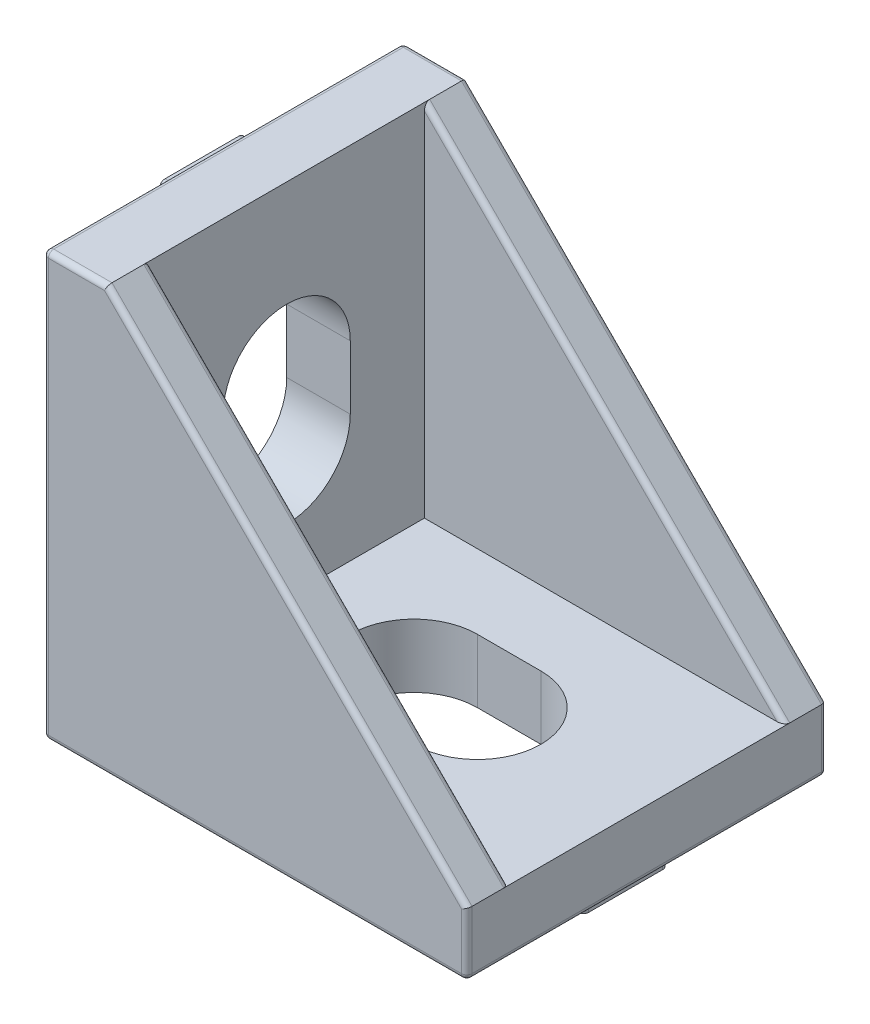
ISO-10303-21;
HEADER;
FILE_DESCRIPTION(('STEP AP214'),'2;1');
FILE_NAME('part.step','',(''),(''),'','','');
FILE_SCHEMA(('AUTOMOTIVE_DESIGN { 1 0 10303 214 1 1 1 1 }'));
ENDSEC;
DATA;
#1=APPLICATION_CONTEXT('core data for automotive mechanical design processes');
#2=APPLICATION_PROTOCOL_DEFINITION('international standard','automotive_design',2000,#1);
#3=PRODUCT_CONTEXT('',#1,'mechanical');
#4=PRODUCT('Part','Part','',(#3));
#5=PRODUCT_RELATED_PRODUCT_CATEGORY('part','',(#4));
#6=PRODUCT_DEFINITION_FORMATION('','',#4);
#7=PRODUCT_DEFINITION_CONTEXT('part definition',#1,'design');
#8=PRODUCT_DEFINITION('design','',#6,#7);
#9=PRODUCT_DEFINITION_SHAPE('','',#8);
#10=(LENGTH_UNIT() NAMED_UNIT(*) SI_UNIT(.MILLI.,.METRE.));
#11=(NAMED_UNIT(*) PLANE_ANGLE_UNIT() SI_UNIT($,.RADIAN.));
#12=(NAMED_UNIT(*) SI_UNIT($,.STERADIAN.) SOLID_ANGLE_UNIT());
#13=UNCERTAINTY_MEASURE_WITH_UNIT(LENGTH_MEASURE(1.E-05),#10,'distance_accuracy_value','');
#14=(GEOMETRIC_REPRESENTATION_CONTEXT(3) GLOBAL_UNCERTAINTY_ASSIGNED_CONTEXT((#13)) GLOBAL_UNIT_ASSIGNED_CONTEXT((#10,
#11,#12)) REPRESENTATION_CONTEXT('',''));
#15=CARTESIAN_POINT('',(0.,0.,0.));
#16=DIRECTION('',(0.,0.,1.));
#17=DIRECTION('',(1.,0.,0.));
#18=AXIS2_PLACEMENT_3D('',#15,#16,#17);
#19=CARTESIAN_POINT('',(0.,0.,0.));
#20=DIRECTION('',(0.,1.,0.));
#21=DIRECTION('',(0.,0.,1.));
#22=AXIS2_PLACEMENT_3D('',#19,#20,#21);
#23=PLANE('',#22);
#24=DIRECTION('',(-1.,0.,0.));
#25=VECTOR('',#24,1.);
#26=CARTESIAN_POINT('',(0.,0.,8.25));
#27=LINE('',#26,#25);
#28=CARTESIAN_POINT('',(19.75,0.,8.25));
#29=VERTEX_POINT('',#28);
#30=CARTESIAN_POINT('',(0.25,0.,8.25));
#31=VERTEX_POINT('',#30);
#32=EDGE_CURVE('E813',#29,#31,#27,.T.);
#33=ORIENTED_EDGE('',*,*,#32,.T.);
#34=DIRECTION('',(0.,0.,-1.));
#35=VECTOR('',#34,1.);
#36=CARTESIAN_POINT('',(0.25,0.,-8.5));
#37=LINE('',#36,#35);
#38=CARTESIAN_POINT('',(0.25,0.,-8.25000000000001));
#39=VERTEX_POINT('',#38);
#40=EDGE_CURVE('E817',#31,#39,#37,.T.);
#41=ORIENTED_EDGE('',*,*,#40,.T.);
#42=DIRECTION('',(1.,0.,0.));
#43=VECTOR('',#42,1.);
#44=CARTESIAN_POINT('',(20.,0.,-8.25000000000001));
#45=LINE('',#44,#43);
#46=CARTESIAN_POINT('',(19.75,0.,-8.25000000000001));
#47=VERTEX_POINT('',#46);
#48=EDGE_CURVE('E810',#39,#47,#45,.T.);
#49=ORIENTED_EDGE('',*,*,#48,.T.);
#50=DIRECTION('',(0.,0.,1.));
#51=VECTOR('',#50,1.);
#52=CARTESIAN_POINT('',(19.75,0.,0.));
#53=LINE('',#52,#51);
#54=EDGE_CURVE('E807',#47,#29,#53,.T.);
#55=ORIENTED_EDGE('',*,*,#54,.T.);
#56=EDGE_LOOP('',(#33,#41,#49,#55));
#57=FACE_BOUND('',#56,.T.);
#58=DIRECTION('',(-1.,0.,0.));
#59=VECTOR('',#58,1.);
#60=CARTESIAN_POINT('',(2.,0.,2.));
#61=LINE('',#60,#59);
#62=CARTESIAN_POINT('',(3.75,0.,2.));
#63=VERTEX_POINT('',#62);
#64=CARTESIAN_POINT('',(2.25,0.,2.));
#65=VERTEX_POINT('',#64);
#66=EDGE_CURVE('E578',#63,#65,#61,.T.);
#67=ORIENTED_EDGE('',*,*,#66,.F.);
#68=CARTESIAN_POINT('',(3.75,0.,1.75));
#69=DIRECTION('',(0.,1.,0.));
#70=DIRECTION('',(0.,0.,1.));
#71=AXIS2_PLACEMENT_3D('',#68,#69,#70);
#72=CIRCLE('',#71,0.25);
#73=CARTESIAN_POINT('',(4.,0.,1.75));
#74=VERTEX_POINT('',#73);
#75=EDGE_CURVE('E418',#63,#74,#72,.T.);
#76=ORIENTED_EDGE('',*,*,#75,.T.);
#77=DIRECTION('',(0.,0.,1.));
#78=VECTOR('',#77,1.);
#79=CARTESIAN_POINT('',(4.,0.,2.));
#80=LINE('',#79,#78);
#81=CARTESIAN_POINT('',(4.,0.,-1.75));
#82=VERTEX_POINT('',#81);
#83=EDGE_CURVE('E565',#82,#74,#80,.T.);
#84=ORIENTED_EDGE('',*,*,#83,.F.);
#85=CARTESIAN_POINT('',(3.75,0.,-1.75));
#86=DIRECTION('',(0.,1.,0.));
#87=DIRECTION('',(0.,0.,1.));
#88=AXIS2_PLACEMENT_3D('',#85,#86,#87);
#89=CIRCLE('',#88,0.25);
#90=CARTESIAN_POINT('',(3.75,0.,-2.));
#91=VERTEX_POINT('',#90);
#92=EDGE_CURVE('E421',#82,#91,#89,.T.);
#93=ORIENTED_EDGE('',*,*,#92,.T.);
#94=DIRECTION('',(1.,0.,0.));
#95=VECTOR('',#94,1.);
#96=CARTESIAN_POINT('',(4.,0.,-2.));
#97=LINE('',#96,#95);
#98=CARTESIAN_POINT('',(2.25,0.,-2.));
#99=VERTEX_POINT('',#98);
#100=EDGE_CURVE('E586',#99,#91,#97,.T.);
#101=ORIENTED_EDGE('',*,*,#100,.F.);
#102=CARTESIAN_POINT('',(2.25,0.,-1.75));
#103=DIRECTION('',(0.,1.,0.));
#104=DIRECTION('',(0.,0.,1.));
#105=AXIS2_PLACEMENT_3D('',#102,#103,#104);
#106=CIRCLE('',#105,0.25);
#107=CARTESIAN_POINT('',(2.,0.,-1.75));
#108=VERTEX_POINT('',#107);
#109=EDGE_CURVE('E424',#99,#108,#106,.T.);
#110=ORIENTED_EDGE('',*,*,#109,.T.);
#111=DIRECTION('',(0.,0.,-1.));
#112=VECTOR('',#111,1.);
#113=CARTESIAN_POINT('',(2.,0.,-2.));
#114=LINE('',#113,#112);
#115=CARTESIAN_POINT('',(2.,0.,1.75));
#116=VERTEX_POINT('',#115);
#117=EDGE_CURVE('E582',#116,#108,#114,.T.);
#118=ORIENTED_EDGE('',*,*,#117,.F.);
#119=CARTESIAN_POINT('',(2.25,0.,1.75));
#120=DIRECTION('',(0.,1.,0.));
#121=DIRECTION('',(0.,0.,1.));
#122=AXIS2_PLACEMENT_3D('',#119,#120,#121);
#123=CIRCLE('',#122,0.25);
#124=EDGE_CURVE('E415',#116,#65,#123,.T.);
#125=ORIENTED_EDGE('',*,*,#124,.T.);
#126=EDGE_LOOP('',(#67,#76,#84,#93,#101,#110,#118,#125));
#127=FACE_BOUND('',#126,.T.);
#128=DIRECTION('',(1.,0.,0.));
#129=VECTOR('',#128,1.);
#130=CARTESIAN_POINT('',(9.,0.,-3.));
#131=LINE('',#130,#129);
#132=CARTESIAN_POINT('',(9.,0.,-3.));
#133=VERTEX_POINT('',#132);
#134=CARTESIAN_POINT('',(12.,0.,-3.));
#135=VERTEX_POINT('',#134);
#136=EDGE_CURVE('E651',#133,#135,#131,.T.);
#137=ORIENTED_EDGE('',*,*,#136,.F.);
#138=CARTESIAN_POINT('',(9.,0.,0.));
#139=DIRECTION('',(0.,-1.,0.));
#140=DIRECTION('',(0.,0.,-1.));
#141=AXIS2_PLACEMENT_3D('',#138,#139,#140);
#142=CIRCLE('',#141,3.);
#143=CARTESIAN_POINT('',(9.,0.,3.));
#144=VERTEX_POINT('',#143);
#145=EDGE_CURVE('E378',#144,#133,#142,.T.);
#146=ORIENTED_EDGE('',*,*,#145,.F.);
#147=DIRECTION('',(-1.,0.,0.));
#148=VECTOR('',#147,1.);
#149=CARTESIAN_POINT('',(12.,0.,3.));
#150=LINE('',#149,#148);
#151=CARTESIAN_POINT('',(12.,0.,3.));
#152=VERTEX_POINT('',#151);
#153=EDGE_CURVE('E659',#152,#144,#150,.T.);
#154=ORIENTED_EDGE('',*,*,#153,.F.);
#155=CARTESIAN_POINT('',(12.,0.,0.));
#156=DIRECTION('',(0.,-1.,0.));
#157=DIRECTION('',(0.,0.,-1.));
#158=AXIS2_PLACEMENT_3D('',#155,#156,#157);
#159=CIRCLE('',#158,3.);
#160=EDGE_CURVE('E655',#135,#152,#159,.T.);
#161=ORIENTED_EDGE('',*,*,#160,.F.);
#162=EDGE_LOOP('',(#137,#146,#154,#161));
#163=FACE_BOUND('',#162,.T.);
#164=DIRECTION('',(-1.,0.,0.));
#165=VECTOR('',#164,1.);
#166=CARTESIAN_POINT('',(17.,0.,2.));
#167=LINE('',#166,#165);
#168=CARTESIAN_POINT('',(18.75,0.,2.));
#169=VERTEX_POINT('',#168);
#170=CARTESIAN_POINT('',(17.25,0.,2.));
#171=VERTEX_POINT('',#170);
#172=EDGE_CURVE('E532',#169,#171,#167,.T.);
#173=ORIENTED_EDGE('',*,*,#172,.F.);
#174=CARTESIAN_POINT('',(18.75,0.,1.75));
#175=DIRECTION('',(0.,1.,0.));
#176=DIRECTION('',(0.,0.,1.));
#177=AXIS2_PLACEMENT_3D('',#174,#175,#176);
#178=CIRCLE('',#177,0.25);
#179=CARTESIAN_POINT('',(19.,0.,1.75));
#180=VERTEX_POINT('',#179);
#181=EDGE_CURVE('E403',#169,#180,#178,.T.);
#182=ORIENTED_EDGE('',*,*,#181,.T.);
#183=DIRECTION('',(0.,0.,1.));
#184=VECTOR('',#183,1.);
#185=CARTESIAN_POINT('',(19.,0.,2.));
#186=LINE('',#185,#184);
#187=CARTESIAN_POINT('',(19.,0.,-1.75));
#188=VERTEX_POINT('',#187);
#189=EDGE_CURVE('E555',#188,#180,#186,.T.);
#190=ORIENTED_EDGE('',*,*,#189,.F.);
#191=CARTESIAN_POINT('',(18.75,0.,-1.75));
#192=DIRECTION('',(0.,1.,0.));
#193=DIRECTION('',(0.,0.,1.));
#194=AXIS2_PLACEMENT_3D('',#191,#192,#193);
#195=CIRCLE('',#194,0.25);
#196=CARTESIAN_POINT('',(18.75,0.,-2.));
#197=VERTEX_POINT('',#196);
#198=EDGE_CURVE('E409',#188,#197,#195,.T.);
#199=ORIENTED_EDGE('',*,*,#198,.T.);
#200=DIRECTION('',(1.,0.,0.));
#201=VECTOR('',#200,1.);
#202=CARTESIAN_POINT('',(19.,0.,-2.));
#203=LINE('',#202,#201);
#204=CARTESIAN_POINT('',(17.25,0.,-2.));
#205=VERTEX_POINT('',#204);
#206=EDGE_CURVE('E546',#205,#197,#203,.T.);
#207=ORIENTED_EDGE('',*,*,#206,.F.);
#208=CARTESIAN_POINT('',(17.25,0.,-1.75));
#209=DIRECTION('',(0.,1.,0.));
#210=DIRECTION('',(0.,0.,1.));
#211=AXIS2_PLACEMENT_3D('',#208,#209,#210);
#212=CIRCLE('',#211,0.25);
#213=CARTESIAN_POINT('',(17.,0.,-1.75));
#214=VERTEX_POINT('',#213);
#215=EDGE_CURVE('E412',#205,#214,#212,.T.);
#216=ORIENTED_EDGE('',*,*,#215,.T.);
#217=DIRECTION('',(0.,0.,-1.));
#218=VECTOR('',#217,1.);
#219=CARTESIAN_POINT('',(17.,0.,-2.));
#220=LINE('',#219,#218);
#221=CARTESIAN_POINT('',(17.,0.,1.75));
#222=VERTEX_POINT('',#221);
#223=EDGE_CURVE('E538',#222,#214,#220,.T.);
#224=ORIENTED_EDGE('',*,*,#223,.F.);
#225=CARTESIAN_POINT('',(17.25,0.,1.75));
#226=DIRECTION('',(0.,1.,0.));
#227=DIRECTION('',(0.,0.,1.));
#228=AXIS2_PLACEMENT_3D('',#225,#226,#227);
#229=CIRCLE('',#228,0.25);
#230=EDGE_CURVE('E406',#222,#171,#229,.T.);
#231=ORIENTED_EDGE('',*,*,#230,.T.);
#232=EDGE_LOOP('',(#173,#182,#190,#199,#207,#216,#224,#231));
#233=FACE_BOUND('',#232,.T.);
#234=ADVANCED_FACE('F42',(#57,#127,#163,#233),#23,.F.);
#235=CARTESIAN_POINT('',(0.,3.,8.5));
#236=DIRECTION('',(-1.,0.,0.));
#237=DIRECTION('',(0.,-1.,0.));
#238=AXIS2_PLACEMENT_3D('',#235,#236,#237);
#239=PLANE('',#238);
#240=DIRECTION('',(0.,1.,0.));
#241=VECTOR('',#240,1.);
#242=CARTESIAN_POINT('',(0.,2.99999999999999,-8.25000000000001));
#243=LINE('',#242,#241);
#244=CARTESIAN_POINT('',(0.,19.75,-8.25000000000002));
#245=VERTEX_POINT('',#244);
#246=CARTESIAN_POINT('',(0.,0.25,-8.25000000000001));
#247=VERTEX_POINT('',#246);
#248=EDGE_CURVE('E823',#245,#247,#243,.F.);
#249=ORIENTED_EDGE('',*,*,#248,.T.);
#250=DIRECTION('',(0.,0.,-1.));
#251=VECTOR('',#250,1.);
#252=CARTESIAN_POINT('',(0.,0.25,8.5));
#253=LINE('',#252,#251);
#254=CARTESIAN_POINT('',(0.,0.25,8.25));
#255=VERTEX_POINT('',#254);
#256=EDGE_CURVE('E830',#247,#255,#253,.F.);
#257=ORIENTED_EDGE('',*,*,#256,.T.);
#258=DIRECTION('',(0.,1.,0.));
#259=VECTOR('',#258,1.);
#260=CARTESIAN_POINT('',(0.,20.,8.25));
#261=LINE('',#260,#259);
#262=CARTESIAN_POINT('',(0.,19.75,8.25));
#263=VERTEX_POINT('',#262);
#264=EDGE_CURVE('E826',#255,#263,#261,.T.);
#265=ORIENTED_EDGE('',*,*,#264,.T.);
#266=DIRECTION('',(0.,0.,-1.));
#267=VECTOR('',#266,1.);
#268=CARTESIAN_POINT('',(0.,19.75,8.5));
#269=LINE('',#268,#267);
#270=EDGE_CURVE('E820',#263,#245,#269,.T.);
#271=ORIENTED_EDGE('',*,*,#270,.T.);
#272=EDGE_LOOP('',(#249,#257,#265,#271));
#273=FACE_BOUND('',#272,.T.);
#274=CARTESIAN_POINT('',(0.,9.,0.));
#275=DIRECTION('',(1.,0.,0.));
#276=DIRECTION('',(0.,1.,0.));
#277=AXIS2_PLACEMENT_3D('',#274,#275,#276);
#278=CIRCLE('',#277,3.);
#279=CARTESIAN_POINT('',(0.,9.,3.));
#280=VERTEX_POINT('',#279);
#281=CARTESIAN_POINT('',(0.,9.,-3.));
#282=VERTEX_POINT('',#281);
#283=EDGE_CURVE('E696',#280,#282,#278,.T.);
#284=ORIENTED_EDGE('',*,*,#283,.T.);
#285=DIRECTION('',(0.,1.,0.));
#286=VECTOR('',#285,1.);
#287=CARTESIAN_POINT('',(0.,9.,-3.));
#288=LINE('',#287,#286);
#289=CARTESIAN_POINT('',(0.,12.,-3.));
#290=VERTEX_POINT('',#289);
#291=EDGE_CURVE('E700',#282,#290,#288,.T.);
#292=ORIENTED_EDGE('',*,*,#291,.T.);
#293=CARTESIAN_POINT('',(0.,12.,0.));
#294=DIRECTION('',(1.,0.,0.));
#295=DIRECTION('',(0.,1.,0.));
#296=AXIS2_PLACEMENT_3D('',#293,#294,#295);
#297=CIRCLE('',#296,3.);
#298=CARTESIAN_POINT('',(0.,12.,3.));
#299=VERTEX_POINT('',#298);
#300=EDGE_CURVE('E705',#290,#299,#297,.T.);
#301=ORIENTED_EDGE('',*,*,#300,.T.);
#302=DIRECTION('',(0.,-1.,0.));
#303=VECTOR('',#302,1.);
#304=CARTESIAN_POINT('',(0.,12.,3.));
#305=LINE('',#304,#303);
#306=EDGE_CURVE('E709',#299,#280,#305,.T.);
#307=ORIENTED_EDGE('',*,*,#306,.T.);
#308=EDGE_LOOP('',(#284,#292,#301,#307));
#309=FACE_BOUND('',#308,.T.);
#310=DIRECTION('',(0.,0.,1.));
#311=VECTOR('',#310,1.);
#312=CARTESIAN_POINT('',(0.,17.,2.));
#313=LINE('',#312,#311);
#314=CARTESIAN_POINT('',(0.,17.,-1.75));
#315=VERTEX_POINT('',#314);
#316=CARTESIAN_POINT('',(0.,17.,1.75));
#317=VERTEX_POINT('',#316);
#318=EDGE_CURVE('E638',#315,#317,#313,.T.);
#319=ORIENTED_EDGE('',*,*,#318,.F.);
#320=CARTESIAN_POINT('',(0.,17.25,-1.75));
#321=DIRECTION('',(-1.,0.,0.));
#322=DIRECTION('',(0.,-1.,0.));
#323=AXIS2_PLACEMENT_3D('',#320,#321,#322);
#324=CIRCLE('',#323,0.25);
#325=CARTESIAN_POINT('',(0.,17.25,-2.));
#326=VERTEX_POINT('',#325);
#327=EDGE_CURVE('E442',#315,#326,#324,.F.);
#328=ORIENTED_EDGE('',*,*,#327,.T.);
#329=DIRECTION('',(0.,-1.,0.));
#330=VECTOR('',#329,1.);
#331=CARTESIAN_POINT('',(0.,17.,-2.));
#332=LINE('',#331,#330);
#333=CARTESIAN_POINT('',(0.,18.75,-2.));
#334=VERTEX_POINT('',#333);
#335=EDGE_CURVE('E610',#334,#326,#332,.T.);
#336=ORIENTED_EDGE('',*,*,#335,.F.);
#337=CARTESIAN_POINT('',(0.,18.75,-1.75));
#338=DIRECTION('',(-1.,0.,0.));
#339=DIRECTION('',(0.,-1.,0.));
#340=AXIS2_PLACEMENT_3D('',#337,#338,#339);
#341=CIRCLE('',#340,0.25);
#342=CARTESIAN_POINT('',(0.,19.,-1.75));
#343=VERTEX_POINT('',#342);
#344=EDGE_CURVE('E52',#334,#343,#341,.F.);
#345=ORIENTED_EDGE('',*,*,#344,.T.);
#346=DIRECTION('',(0.,0.,-1.));
#347=VECTOR('',#346,1.);
#348=CARTESIAN_POINT('',(0.,19.,-2.));
#349=LINE('',#348,#347);
#350=CARTESIAN_POINT('',(0.,19.,1.75));
#351=VERTEX_POINT('',#350);
#352=EDGE_CURVE('E630',#351,#343,#349,.T.);
#353=ORIENTED_EDGE('',*,*,#352,.F.);
#354=CARTESIAN_POINT('',(0.,18.75,1.75));
#355=DIRECTION('',(-1.,0.,0.));
#356=DIRECTION('',(0.,-1.,0.));
#357=AXIS2_PLACEMENT_3D('',#354,#355,#356);
#358=CIRCLE('',#357,0.25);
#359=CARTESIAN_POINT('',(0.,18.75,2.));
#360=VERTEX_POINT('',#359);
#361=EDGE_CURVE('E11',#351,#360,#358,.F.);
#362=ORIENTED_EDGE('',*,*,#361,.T.);
#363=DIRECTION('',(0.,1.,0.));
#364=VECTOR('',#363,1.);
#365=CARTESIAN_POINT('',(0.,19.,2.));
#366=LINE('',#365,#364);
#367=CARTESIAN_POINT('',(0.,17.25,2.));
#368=VERTEX_POINT('',#367);
#369=EDGE_CURVE('E642',#368,#360,#366,.T.);
#370=ORIENTED_EDGE('',*,*,#369,.F.);
#371=CARTESIAN_POINT('',(0.,17.25,1.75));
#372=DIRECTION('',(-1.,0.,0.));
#373=DIRECTION('',(0.,-1.,0.));
#374=AXIS2_PLACEMENT_3D('',#371,#372,#373);
#375=CIRCLE('',#374,0.25);
#376=EDGE_CURVE('E439',#368,#317,#375,.F.);
#377=ORIENTED_EDGE('',*,*,#376,.T.);
#378=EDGE_LOOP('',(#319,#328,#336,#345,#353,#362,#370,#377));
#379=FACE_BOUND('',#378,.T.);
#380=DIRECTION('',(0.,0.,1.));
#381=VECTOR('',#380,1.);
#382=CARTESIAN_POINT('',(0.,2.,2.));
#383=LINE('',#382,#381);
#384=CARTESIAN_POINT('',(0.,2.,-1.75));
#385=VERTEX_POINT('',#384);
#386=CARTESIAN_POINT('',(0.,2.,1.75));
#387=VERTEX_POINT('',#386);
#388=EDGE_CURVE('E614',#385,#387,#383,.T.);
#389=ORIENTED_EDGE('',*,*,#388,.F.);
#390=CARTESIAN_POINT('',(0.,2.25,-1.75));
#391=DIRECTION('',(-1.,0.,0.));
#392=DIRECTION('',(0.,-1.,0.));
#393=AXIS2_PLACEMENT_3D('',#390,#391,#392);
#394=CIRCLE('',#393,0.25);
#395=CARTESIAN_POINT('',(0.,2.25,-2.));
#396=VERTEX_POINT('',#395);
#397=EDGE_CURVE('E427',#385,#396,#394,.F.);
#398=ORIENTED_EDGE('',*,*,#397,.T.);
#399=DIRECTION('',(0.,-1.,0.));
#400=VECTOR('',#399,1.);
#401=CARTESIAN_POINT('',(0.,2.,-2.));
#402=LINE('',#401,#400);
#403=CARTESIAN_POINT('',(0.,3.75,-2.));
#404=VERTEX_POINT('',#403);
#405=EDGE_CURVE('E577',#404,#396,#402,.T.);
#406=ORIENTED_EDGE('',*,*,#405,.F.);
#407=CARTESIAN_POINT('',(0.,3.75,-1.75));
#408=DIRECTION('',(-1.,0.,0.));
#409=DIRECTION('',(0.,-1.,0.));
#410=AXIS2_PLACEMENT_3D('',#407,#408,#409);
#411=CIRCLE('',#410,0.25);
#412=CARTESIAN_POINT('',(0.,4.,-1.75));
#413=VERTEX_POINT('',#412);
#414=EDGE_CURVE('E430',#404,#413,#411,.F.);
#415=ORIENTED_EDGE('',*,*,#414,.T.);
#416=DIRECTION('',(0.,0.,-1.));
#417=VECTOR('',#416,1.);
#418=CARTESIAN_POINT('',(0.,4.,-2.));
#419=LINE('',#418,#417);
#420=CARTESIAN_POINT('',(0.,4.,1.75));
#421=VERTEX_POINT('',#420);
#422=EDGE_CURVE('E598',#421,#413,#419,.T.);
#423=ORIENTED_EDGE('',*,*,#422,.F.);
#424=CARTESIAN_POINT('',(0.,3.75,1.75));
#425=DIRECTION('',(-1.,0.,0.));
#426=DIRECTION('',(0.,-1.,0.));
#427=AXIS2_PLACEMENT_3D('',#424,#425,#426);
#428=CIRCLE('',#427,0.25);
#429=CARTESIAN_POINT('',(0.,3.75,2.));
#430=VERTEX_POINT('',#429);
#431=EDGE_CURVE('E436',#421,#430,#428,.F.);
#432=ORIENTED_EDGE('',*,*,#431,.T.);
#433=DIRECTION('',(0.,1.,0.));
#434=VECTOR('',#433,1.);
#435=CARTESIAN_POINT('',(0.,4.,2.));
#436=LINE('',#435,#434);
#437=CARTESIAN_POINT('',(0.,2.25,2.));
#438=VERTEX_POINT('',#437);
#439=EDGE_CURVE('E618',#438,#430,#436,.T.);
#440=ORIENTED_EDGE('',*,*,#439,.F.);
#441=CARTESIAN_POINT('',(0.,2.25,1.75));
#442=DIRECTION('',(-1.,0.,0.));
#443=DIRECTION('',(0.,-1.,0.));
#444=AXIS2_PLACEMENT_3D('',#441,#442,#443);
#445=CIRCLE('',#444,0.25);
#446=EDGE_CURVE('E433',#438,#387,#445,.F.);
#447=ORIENTED_EDGE('',*,*,#446,.T.);
#448=EDGE_LOOP('',(#389,#398,#406,#415,#423,#432,#440,#447));
#449=FACE_BOUND('',#448,.T.);
#450=ADVANCED_FACE('F1029',(#273,#309,#379,#449),#239,.T.);
#451=CARTESIAN_POINT('',(3.,20.,8.5));
#452=DIRECTION('',(0.707106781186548,0.707106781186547,0.));
#453=DIRECTION('',(-0.707106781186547,0.707106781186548,0.));
#454=AXIS2_PLACEMENT_3D('',#451,#452,#453);
#455=PLANE('',#454);
#456=DIRECTION('',(0.,0.,-1.));
#457=VECTOR('',#456,1.);
#458=CARTESIAN_POINT('',(3.,20.,8.5));
#459=LINE('',#458,#457);
#460=CARTESIAN_POINT('',(3.,20.,8.25));
#461=VERTEX_POINT('',#460);
#462=CARTESIAN_POINT('',(3.,20.,6.75));
#463=VERTEX_POINT('',#462);
#464=EDGE_CURVE('E774',#461,#463,#459,.T.);
#465=ORIENTED_EDGE('',*,*,#464,.F.);
#466=DIRECTION('',(0.707106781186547,-0.707106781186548,0.));
#467=VECTOR('',#466,1.);
#468=CARTESIAN_POINT('',(20.,3.,8.25));
#469=LINE('',#468,#467);
#470=CARTESIAN_POINT('',(20.,3.,8.25));
#471=VERTEX_POINT('',#470);
#472=EDGE_CURVE('E846',#461,#471,#469,.T.);
#473=ORIENTED_EDGE('',*,*,#472,.T.);
#474=DIRECTION('',(0.,0.,-1.));
#475=VECTOR('',#474,1.);
#476=CARTESIAN_POINT('',(20.,3.,8.5));
#477=LINE('',#476,#475);
#478=CARTESIAN_POINT('',(20.,3.,6.75));
#479=VERTEX_POINT('',#478);
#480=EDGE_CURVE('E773',#471,#479,#477,.T.);
#481=ORIENTED_EDGE('',*,*,#480,.T.);
#482=DIRECTION('',(0.707106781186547,-0.707106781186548,0.));
#483=VECTOR('',#482,1.);
#484=CARTESIAN_POINT('',(3.,20.,6.75));
#485=LINE('',#484,#483);
#486=EDGE_CURVE('E842',#479,#463,#485,.F.);
#487=ORIENTED_EDGE('',*,*,#486,.T.);
#488=EDGE_LOOP('',(#465,#473,#481,#487));
#489=FACE_BOUND('',#488,.T.);
#490=ADVANCED_FACE('F1059',(#489),#455,.T.);
#491=CARTESIAN_POINT('',(0.,20.,8.5));
#492=DIRECTION('',(0.,1.,0.));
#493=DIRECTION('',(-1.,0.,0.));
#494=AXIS2_PLACEMENT_3D('',#491,#492,#493);
#495=PLANE('',#494);
#496=DIRECTION('',(0.,0.,-1.));
#497=VECTOR('',#496,1.);
#498=CARTESIAN_POINT('',(0.25,20.,8.5));
#499=LINE('',#498,#497);
#500=CARTESIAN_POINT('',(0.25,20.,-8.25000000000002));
#501=VERTEX_POINT('',#500);
#502=CARTESIAN_POINT('',(0.25,20.,8.25));
#503=VERTEX_POINT('',#502);
#504=EDGE_CURVE('E833',#501,#503,#499,.F.);
#505=ORIENTED_EDGE('',*,*,#504,.T.);
#506=DIRECTION('',(1.,0.,0.));
#507=VECTOR('',#506,1.);
#508=CARTESIAN_POINT('',(3.,20.,8.25));
#509=LINE('',#508,#507);
#510=EDGE_CURVE('E839',#503,#461,#509,.T.);
#511=ORIENTED_EDGE('',*,*,#510,.T.);
#512=ORIENTED_EDGE('',*,*,#464,.T.);
#513=DIRECTION('',(0.,0.,1.));
#514=VECTOR('',#513,1.);
#515=CARTESIAN_POINT('',(3.,20.,-6.50000000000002));
#516=LINE('',#515,#514);
#517=CARTESIAN_POINT('',(3.,20.,-6.75000000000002));
#518=VERTEX_POINT('',#517);
#519=EDGE_CURVE('E60',#518,#463,#516,.T.);
#520=ORIENTED_EDGE('',*,*,#519,.F.);
#521=DIRECTION('',(0.,0.,1.));
#522=VECTOR('',#521,1.);
#523=CARTESIAN_POINT('',(3.,20.,-8.50000000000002));
#524=LINE('',#523,#522);
#525=CARTESIAN_POINT('',(3.,20.,-8.25000000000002));
#526=VERTEX_POINT('',#525);
#527=EDGE_CURVE('E752',#526,#518,#524,.T.);
#528=ORIENTED_EDGE('',*,*,#527,.F.);
#529=DIRECTION('',(1.,0.,0.));
#530=VECTOR('',#529,1.);
#531=CARTESIAN_POINT('',(0.,20.,-8.25000000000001));
#532=LINE('',#531,#530);
#533=EDGE_CURVE('E836',#526,#501,#532,.F.);
#534=ORIENTED_EDGE('',*,*,#533,.T.);
#535=EDGE_LOOP('',(#505,#511,#512,#520,#528,#534));
#536=FACE_BOUND('',#535,.T.);
#537=ADVANCED_FACE('F1094',(#536),#495,.T.);
#538=CARTESIAN_POINT('',(0.,0.,8.5));
#539=DIRECTION('',(0.,0.,-1.));
#540=DIRECTION('',(-1.,0.,0.));
#541=AXIS2_PLACEMENT_3D('',#538,#539,#540);
#542=PLANE('',#541);
#543=DIRECTION('',(-1.,0.,0.));
#544=VECTOR('',#543,1.);
#545=CARTESIAN_POINT('',(0.,0.25,8.5));
#546=LINE('',#545,#544);
#547=CARTESIAN_POINT('',(0.25,0.25,8.5));
#548=VERTEX_POINT('',#547);
#549=CARTESIAN_POINT('',(19.75,0.25,8.5));
#550=VERTEX_POINT('',#549);
#551=EDGE_CURVE('E791',#548,#550,#546,.F.);
#552=ORIENTED_EDGE('',*,*,#551,.T.);
#553=DIRECTION('',(0.,1.,0.));
#554=VECTOR('',#553,1.);
#555=CARTESIAN_POINT('',(19.75,0.,8.5));
#556=LINE('',#555,#554);
#557=CARTESIAN_POINT('',(19.75,2.89644660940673,8.5));
#558=VERTEX_POINT('',#557);
#559=EDGE_CURVE('E794',#550,#558,#556,.T.);
#560=ORIENTED_EDGE('',*,*,#559,.T.);
#561=DIRECTION('',(0.707106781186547,-0.707106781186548,0.));
#562=VECTOR('',#561,1.);
#563=CARTESIAN_POINT('',(2.82322330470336,19.8232233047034,8.5));
#564=LINE('',#563,#562);
#565=CARTESIAN_POINT('',(2.89644660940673,19.75,8.5));
#566=VERTEX_POINT('',#565);
#567=EDGE_CURVE('E777',#558,#566,#564,.F.);
#568=ORIENTED_EDGE('',*,*,#567,.T.);
#569=DIRECTION('',(1.,0.,0.));
#570=VECTOR('',#569,1.);
#571=CARTESIAN_POINT('',(0.,19.75,8.5));
#572=LINE('',#571,#570);
#573=CARTESIAN_POINT('',(0.25,19.75,8.5));
#574=VERTEX_POINT('',#573);
#575=EDGE_CURVE('E783',#566,#574,#572,.F.);
#576=ORIENTED_EDGE('',*,*,#575,.T.);
#577=DIRECTION('',(0.,1.,0.));
#578=VECTOR('',#577,1.);
#579=CARTESIAN_POINT('',(0.25,0.,8.5));
#580=LINE('',#579,#578);
#581=EDGE_CURVE('E787',#574,#548,#580,.F.);
#582=ORIENTED_EDGE('',*,*,#581,.T.);
#583=EDGE_LOOP('',(#552,#560,#568,#576,#582));
#584=FACE_BOUND('',#583,.T.);
#585=ADVANCED_FACE('F1091',(#584),#542,.F.);
#586=CARTESIAN_POINT('',(0.,0.,6.5));
#587=DIRECTION('',(0.,0.,-1.));
#588=DIRECTION('',(-1.,0.,0.));
#589=AXIS2_PLACEMENT_3D('',#586,#587,#588);
#590=PLANE('',#589);
#591=DIRECTION('',(0.,-1.,0.));
#592=VECTOR('',#591,1.);
#593=CARTESIAN_POINT('',(3.,3.,6.5));
#594=LINE('',#593,#592);
#595=CARTESIAN_POINT('',(3.,19.6464466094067,6.49999999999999));
#596=VERTEX_POINT('',#595);
#597=CARTESIAN_POINT('',(3.,3.,6.5));
#598=VERTEX_POINT('',#597);
#599=EDGE_CURVE('E755',#596,#598,#594,.T.);
#600=ORIENTED_EDGE('',*,*,#599,.F.);
#601=DIRECTION('',(0.707106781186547,-0.707106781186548,0.));
#602=VECTOR('',#601,1.);
#603=CARTESIAN_POINT('',(11.3232233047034,11.3232233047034,6.5));
#604=LINE('',#603,#602);
#605=CARTESIAN_POINT('',(19.6464466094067,3.,6.5));
#606=VERTEX_POINT('',#605);
#607=EDGE_CURVE('E872',#596,#606,#604,.T.);
#608=ORIENTED_EDGE('',*,*,#607,.T.);
#609=DIRECTION('',(-1.,0.,0.));
#610=VECTOR('',#609,1.);
#611=CARTESIAN_POINT('',(20.,3.,6.5));
#612=LINE('',#611,#610);
#613=EDGE_CURVE('E769',#606,#598,#612,.T.);
#614=ORIENTED_EDGE('',*,*,#613,.T.);
#615=EDGE_LOOP('',(#600,#608,#614));
#616=FACE_BOUND('',#615,.T.);
#617=ADVANCED_FACE('F1089',(#616),#590,.T.);
#618=CARTESIAN_POINT('',(3.,2.99999999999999,-6.50000000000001));
#619=DIRECTION('',(-1.,0.,0.));
#620=DIRECTION('',(0.,-1.,0.));
#621=AXIS2_PLACEMENT_3D('',#618,#619,#620);
#622=PLANE('',#621);
#623=DIRECTION('',(0.,1.,0.));
#624=VECTOR('',#623,1.);
#625=CARTESIAN_POINT('',(3.,9.,-3.));
#626=LINE('',#625,#624);
#627=CARTESIAN_POINT('',(3.,9.,-3.));
#628=VERTEX_POINT('',#627);
#629=CARTESIAN_POINT('',(3.,12.,-3.));
#630=VERTEX_POINT('',#629);
#631=EDGE_CURVE('E717',#628,#630,#626,.T.);
#632=ORIENTED_EDGE('',*,*,#631,.F.);
#633=CARTESIAN_POINT('',(3.,9.,0.));
#634=DIRECTION('',(1.,0.,0.));
#635=DIRECTION('',(0.,1.,0.));
#636=AXIS2_PLACEMENT_3D('',#633,#634,#635);
#637=CIRCLE('',#636,3.);
#638=CARTESIAN_POINT('',(3.,9.,3.));
#639=VERTEX_POINT('',#638);
#640=EDGE_CURVE('E695',#639,#628,#637,.T.);
#641=ORIENTED_EDGE('',*,*,#640,.F.);
#642=DIRECTION('',(0.,-1.,0.));
#643=VECTOR('',#642,1.);
#644=CARTESIAN_POINT('',(3.,12.,3.));
#645=LINE('',#644,#643);
#646=CARTESIAN_POINT('',(3.,12.,3.));
#647=VERTEX_POINT('',#646);
#648=EDGE_CURVE('E701',#647,#639,#645,.T.);
#649=ORIENTED_EDGE('',*,*,#648,.F.);
#650=CARTESIAN_POINT('',(3.,12.,0.));
#651=DIRECTION('',(1.,0.,0.));
#652=DIRECTION('',(0.,1.,0.));
#653=AXIS2_PLACEMENT_3D('',#650,#651,#652);
#654=CIRCLE('',#653,3.);
#655=EDGE_CURVE('E721',#630,#647,#654,.T.);
#656=ORIENTED_EDGE('',*,*,#655,.F.);
#657=EDGE_LOOP('',(#632,#641,#649,#656));
#658=FACE_BOUND('',#657,.T.);
#659=ORIENTED_EDGE('',*,*,#519,.T.);
#660=CARTESIAN_POINT('',(3.,19.6464466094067,6.75));
#661=DIRECTION('',(-1.,0.,0.));
#662=DIRECTION('',(0.,-1.,0.));
#663=AXIS2_PLACEMENT_3D('',#660,#661,#662);
#664=ELLIPSE('',#663,0.353553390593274,0.25);
#665=EDGE_CURVE('E393',#463,#596,#664,.T.);
#666=ORIENTED_EDGE('',*,*,#665,.T.);
#667=ORIENTED_EDGE('',*,*,#599,.T.);
#668=DIRECTION('',(0.,0.,1.));
#669=VECTOR('',#668,1.);
#670=CARTESIAN_POINT('',(3.,2.99999999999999,-6.50000000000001));
#671=LINE('',#670,#669);
#672=CARTESIAN_POINT('',(3.,3.,-6.50000000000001));
#673=VERTEX_POINT('',#672);
#674=EDGE_CURVE('E760',#673,#598,#671,.T.);
#675=ORIENTED_EDGE('',*,*,#674,.F.);
#676=DIRECTION('',(0.,-1.,0.));
#677=VECTOR('',#676,1.);
#678=CARTESIAN_POINT('',(3.,2.99999999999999,-6.50000000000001));
#679=LINE('',#678,#677);
#680=CARTESIAN_POINT('',(3.,19.6464466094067,-6.50000000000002));
#681=VERTEX_POINT('',#680);
#682=EDGE_CURVE('E756',#681,#673,#679,.T.);
#683=ORIENTED_EDGE('',*,*,#682,.F.);
#684=CARTESIAN_POINT('',(3.,19.6464466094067,-6.75000000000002));
#685=DIRECTION('',(-1.,0.,0.));
#686=DIRECTION('',(0.,-1.,0.));
#687=AXIS2_PLACEMENT_3D('',#684,#685,#686);
#688=ELLIPSE('',#687,0.353553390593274,0.25);
#689=EDGE_CURVE('E399',#681,#518,#688,.T.);
#690=ORIENTED_EDGE('',*,*,#689,.T.);
#691=EDGE_LOOP('',(#659,#666,#667,#675,#683,#690));
#692=FACE_BOUND('',#691,.T.);
#693=ADVANCED_FACE('F1082',(#658,#692),#622,.F.);
#694=CARTESIAN_POINT('',(0.,0.,-6.50000000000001));
#695=DIRECTION('',(0.,0.,-1.));
#696=DIRECTION('',(0.,1.,0.));
#697=AXIS2_PLACEMENT_3D('',#694,#695,#696);
#698=PLANE('',#697);
#699=DIRECTION('',(-1.,0.,0.));
#700=VECTOR('',#699,1.);
#701=CARTESIAN_POINT('',(0.,3.,-6.50000000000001));
#702=LINE('',#701,#700);
#703=CARTESIAN_POINT('',(19.6464466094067,3.,-6.50000000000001));
#704=VERTEX_POINT('',#703);
#705=EDGE_CURVE('E745',#704,#673,#702,.T.);
#706=ORIENTED_EDGE('',*,*,#705,.F.);
#707=DIRECTION('',(0.707106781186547,-0.707106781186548,0.));
#708=VECTOR('',#707,1.);
#709=CARTESIAN_POINT('',(11.3232233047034,11.3232233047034,-6.50000000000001));
#710=LINE('',#709,#708);
#711=EDGE_CURVE('E876',#704,#681,#710,.F.);
#712=ORIENTED_EDGE('',*,*,#711,.T.);
#713=ORIENTED_EDGE('',*,*,#682,.T.);
#714=EDGE_LOOP('',(#706,#712,#713));
#715=FACE_BOUND('',#714,.T.);
#716=ADVANCED_FACE('F1079',(#715),#698,.F.);
#717=CARTESIAN_POINT('',(20.,3.,-8.50000000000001));
#718=DIRECTION('',(-0.707106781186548,-0.707106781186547,0.));
#719=DIRECTION('',(0.707106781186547,-0.707106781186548,0.));
#720=AXIS2_PLACEMENT_3D('',#717,#718,#719);
#721=PLANE('',#720);
#722=DIRECTION('',(0.,0.,1.));
#723=VECTOR('',#722,1.);
#724=CARTESIAN_POINT('',(20.,3.,-8.50000000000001));
#725=LINE('',#724,#723);
#726=CARTESIAN_POINT('',(20.,3.,-8.25000000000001));
#727=VERTEX_POINT('',#726);
#728=CARTESIAN_POINT('',(20.,3.,-6.75000000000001));
#729=VERTEX_POINT('',#728);
#730=EDGE_CURVE('E749',#727,#729,#725,.T.);
#731=ORIENTED_EDGE('',*,*,#730,.F.);
#732=DIRECTION('',(0.707106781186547,-0.707106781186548,0.));
#733=VECTOR('',#732,1.);
#734=CARTESIAN_POINT('',(3.,20.,-8.25000000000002));
#735=LINE('',#734,#733);
#736=EDGE_CURVE('E869',#727,#526,#735,.F.);
#737=ORIENTED_EDGE('',*,*,#736,.T.);
#738=ORIENTED_EDGE('',*,*,#527,.T.);
#739=DIRECTION('',(0.707106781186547,-0.707106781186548,0.));
#740=VECTOR('',#739,1.);
#741=CARTESIAN_POINT('',(20.,3.,-6.75000000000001));
#742=LINE('',#741,#740);
#743=EDGE_CURVE('E865',#518,#729,#742,.T.);
#744=ORIENTED_EDGE('',*,*,#743,.T.);
#745=EDGE_LOOP('',(#731,#737,#738,#744));
#746=FACE_BOUND('',#745,.T.);
#747=ADVANCED_FACE('F1077',(#746),#721,.F.);
#748=CARTESIAN_POINT('',(0.,0.,-8.50000000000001));
#749=DIRECTION('',(0.,0.,-1.));
#750=DIRECTION('',(0.,1.,0.));
#751=AXIS2_PLACEMENT_3D('',#748,#749,#750);
#752=PLANE('',#751);
#753=DIRECTION('',(0.,1.,0.));
#754=VECTOR('',#753,1.);
#755=CARTESIAN_POINT('',(0.25,0.,-8.50000000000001));
#756=LINE('',#755,#754);
#757=CARTESIAN_POINT('',(0.25,0.25,-8.50000000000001));
#758=VERTEX_POINT('',#757);
#759=CARTESIAN_POINT('',(0.25,19.75,-8.50000000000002));
#760=VERTEX_POINT('',#759);
#761=EDGE_CURVE('E858',#758,#760,#756,.T.);
#762=ORIENTED_EDGE('',*,*,#761,.T.);
#763=DIRECTION('',(1.,0.,0.));
#764=VECTOR('',#763,1.);
#765=CARTESIAN_POINT('',(0.,19.75,-8.50000000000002));
#766=LINE('',#765,#764);
#767=CARTESIAN_POINT('',(2.89644660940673,19.75,-8.50000000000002));
#768=VERTEX_POINT('',#767);
#769=EDGE_CURVE('E861',#760,#768,#766,.T.);
#770=ORIENTED_EDGE('',*,*,#769,.T.);
#771=DIRECTION('',(0.707106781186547,-0.707106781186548,0.));
#772=VECTOR('',#771,1.);
#773=CARTESIAN_POINT('',(19.8232233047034,2.82322330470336,-8.50000000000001));
#774=LINE('',#773,#772);
#775=CARTESIAN_POINT('',(19.75,2.89644660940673,-8.50000000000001));
#776=VERTEX_POINT('',#775);
#777=EDGE_CURVE('E849',#768,#776,#774,.T.);
#778=ORIENTED_EDGE('',*,*,#777,.T.);
#779=DIRECTION('',(0.,1.,0.));
#780=VECTOR('',#779,1.);
#781=CARTESIAN_POINT('',(19.75,0.,-8.50000000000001));
#782=LINE('',#781,#780);
#783=CARTESIAN_POINT('',(19.75,0.25,-8.50000000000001));
#784=VERTEX_POINT('',#783);
#785=EDGE_CURVE('E852',#776,#784,#782,.F.);
#786=ORIENTED_EDGE('',*,*,#785,.T.);
#787=DIRECTION('',(1.,0.,0.));
#788=VECTOR('',#787,1.);
#789=CARTESIAN_POINT('',(0.,0.25,-8.50000000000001));
#790=LINE('',#789,#788);
#791=EDGE_CURVE('E855',#784,#758,#790,.F.);
#792=ORIENTED_EDGE('',*,*,#791,.T.);
#793=EDGE_LOOP('',(#762,#770,#778,#786,#792));
#794=FACE_BOUND('',#793,.T.);
#795=ADVANCED_FACE('F1071',(#794),#752,.T.);
#796=CARTESIAN_POINT('',(0.,3.,0.));
#797=DIRECTION('',(0.,1.,0.));
#798=DIRECTION('',(0.,0.,1.));
#799=AXIS2_PLACEMENT_3D('',#796,#797,#798);
#800=PLANE('',#799);
#801=CARTESIAN_POINT('',(9.,3.,0.));
#802=DIRECTION('',(0.,1.,0.));
#803=DIRECTION('',(0.,0.,1.));
#804=AXIS2_PLACEMENT_3D('',#801,#802,#803);
#805=CIRCLE('',#804,3.);
#806=CARTESIAN_POINT('',(9.,3.,-3.));
#807=VERTEX_POINT('',#806);
#808=CARTESIAN_POINT('',(9.,3.,3.));
#809=VERTEX_POINT('',#808);
#810=EDGE_CURVE('E691',#807,#809,#805,.T.);
#811=ORIENTED_EDGE('',*,*,#810,.F.);
#812=DIRECTION('',(-1.,0.,0.));
#813=VECTOR('',#812,1.);
#814=CARTESIAN_POINT('',(0.,3.,-3.));
#815=LINE('',#814,#813);
#816=CARTESIAN_POINT('',(12.,3.,-3.));
#817=VERTEX_POINT('',#816);
#818=EDGE_CURVE('E668',#817,#807,#815,.T.);
#819=ORIENTED_EDGE('',*,*,#818,.F.);
#820=CARTESIAN_POINT('',(12.,3.,0.));
#821=DIRECTION('',(0.,1.,0.));
#822=DIRECTION('',(0.,0.,1.));
#823=AXIS2_PLACEMENT_3D('',#820,#821,#822);
#824=CIRCLE('',#823,3.);
#825=CARTESIAN_POINT('',(12.,3.,3.));
#826=VERTEX_POINT('',#825);
#827=EDGE_CURVE('E683',#826,#817,#824,.T.);
#828=ORIENTED_EDGE('',*,*,#827,.F.);
#829=DIRECTION('',(1.,0.,0.));
#830=VECTOR('',#829,1.);
#831=CARTESIAN_POINT('',(0.,3.,3.));
#832=LINE('',#831,#830);
#833=EDGE_CURVE('E687',#809,#826,#832,.T.);
#834=ORIENTED_EDGE('',*,*,#833,.F.);
#835=EDGE_LOOP('',(#811,#819,#828,#834));
#836=FACE_BOUND('',#835,.T.);
#837=ORIENTED_EDGE('',*,*,#613,.F.);
#838=CARTESIAN_POINT('',(19.6464466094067,3.,6.75));
#839=DIRECTION('',(0.,1.,0.));
#840=DIRECTION('',(1.,0.,0.));
#841=AXIS2_PLACEMENT_3D('',#838,#839,#840);
#842=ELLIPSE('',#841,0.353553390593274,0.25);
#843=EDGE_CURVE('E385',#606,#479,#842,.F.);
#844=ORIENTED_EDGE('',*,*,#843,.T.);
#845=DIRECTION('',(0.,0.,1.));
#846=VECTOR('',#845,1.);
#847=CARTESIAN_POINT('',(20.,3.,8.5));
#848=LINE('',#847,#846);
#849=EDGE_CURVE('E69',#729,#479,#848,.T.);
#850=ORIENTED_EDGE('',*,*,#849,.F.);
#851=CARTESIAN_POINT('',(19.6464466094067,3.,-6.75000000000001));
#852=DIRECTION('',(0.,1.,0.));
#853=DIRECTION('',(1.,0.,0.));
#854=AXIS2_PLACEMENT_3D('',#851,#852,#853);
#855=ELLIPSE('',#854,0.353553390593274,0.25);
#856=EDGE_CURVE('E396',#729,#704,#855,.F.);
#857=ORIENTED_EDGE('',*,*,#856,.T.);
#858=ORIENTED_EDGE('',*,*,#705,.T.);
#859=ORIENTED_EDGE('',*,*,#674,.T.);
#860=EDGE_LOOP('',(#837,#844,#850,#857,#858,#859));
#861=FACE_BOUND('',#860,.T.);
#862=ADVANCED_FACE('F1067',(#836,#861),#800,.T.);
#863=CARTESIAN_POINT('',(20.,0.,8.5));
#864=DIRECTION('',(-1.,0.,0.));
#865=DIRECTION('',(0.,0.,1.));
#866=AXIS2_PLACEMENT_3D('',#863,#864,#865);
#867=PLANE('',#866);
#868=ORIENTED_EDGE('',*,*,#480,.F.);
#869=DIRECTION('',(0.,1.,0.));
#870=VECTOR('',#869,1.);
#871=CARTESIAN_POINT('',(20.,0.,8.25));
#872=LINE('',#871,#870);
#873=CARTESIAN_POINT('',(20.,0.25,8.25));
#874=VERTEX_POINT('',#873);
#875=EDGE_CURVE('E803',#471,#874,#872,.F.);
#876=ORIENTED_EDGE('',*,*,#875,.T.);
#877=DIRECTION('',(0.,0.,1.));
#878=VECTOR('',#877,1.);
#879=CARTESIAN_POINT('',(20.,0.25,8.5));
#880=LINE('',#879,#878);
#881=CARTESIAN_POINT('',(20.,0.25,-8.25000000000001));
#882=VERTEX_POINT('',#881);
#883=EDGE_CURVE('E798',#874,#882,#880,.F.);
#884=ORIENTED_EDGE('',*,*,#883,.T.);
#885=DIRECTION('',(0.,1.,0.));
#886=VECTOR('',#885,1.);
#887=CARTESIAN_POINT('',(20.,3.,-8.25000000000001));
#888=LINE('',#887,#886);
#889=EDGE_CURVE('E94',#882,#727,#888,.T.);
#890=ORIENTED_EDGE('',*,*,#889,.T.);
#891=ORIENTED_EDGE('',*,*,#730,.T.);
#892=ORIENTED_EDGE('',*,*,#849,.T.);
#893=EDGE_LOOP('',(#868,#876,#884,#890,#891,#892));
#894=FACE_BOUND('',#893,.T.);
#895=ADVANCED_FACE('F1070',(#894),#867,.F.);
#896=CARTESIAN_POINT('',(0.,9.,0.));
#897=DIRECTION('',(1.,0.,0.));
#898=DIRECTION('',(0.,1.,0.));
#899=AXIS2_PLACEMENT_3D('',#896,#897,#898);
#900=CYLINDRICAL_SURFACE('',#899,3.);
#901=ORIENTED_EDGE('',*,*,#640,.T.);
#902=DIRECTION('',(1.,0.,0.));
#903=VECTOR('',#902,1.);
#904=CARTESIAN_POINT('',(0.,9.,-3.));
#905=LINE('',#904,#903);
#906=EDGE_CURVE('E713',#282,#628,#905,.T.);
#907=ORIENTED_EDGE('',*,*,#906,.F.);
#908=ORIENTED_EDGE('',*,*,#283,.F.);
#909=DIRECTION('',(1.,0.,0.));
#910=VECTOR('',#909,1.);
#911=CARTESIAN_POINT('',(0.,9.,3.));
#912=LINE('',#911,#910);
#913=EDGE_CURVE('E728',#280,#639,#912,.T.);
#914=ORIENTED_EDGE('',*,*,#913,.T.);
#915=EDGE_LOOP('',(#901,#907,#908,#914));
#916=FACE_BOUND('',#915,.T.);
#917=ADVANCED_FACE('F1065',(#916),#900,.F.);
#918=CARTESIAN_POINT('',(0.,12.,3.));
#919=DIRECTION('',(0.,0.,1.));
#920=DIRECTION('',(1.,0.,0.));
#921=AXIS2_PLACEMENT_3D('',#918,#919,#920);
#922=PLANE('',#921);
#923=ORIENTED_EDGE('',*,*,#648,.T.);
#924=ORIENTED_EDGE('',*,*,#913,.F.);
#925=ORIENTED_EDGE('',*,*,#306,.F.);
#926=DIRECTION('',(1.,0.,0.));
#927=VECTOR('',#926,1.);
#928=CARTESIAN_POINT('',(0.,12.,3.));
#929=LINE('',#928,#927);
#930=EDGE_CURVE('E732',#299,#647,#929,.T.);
#931=ORIENTED_EDGE('',*,*,#930,.T.);
#932=EDGE_LOOP('',(#923,#924,#925,#931));
#933=FACE_BOUND('',#932,.T.);
#934=ADVANCED_FACE('F1720',(#933),#922,.F.);
#935=CARTESIAN_POINT('',(0.,12.,0.));
#936=DIRECTION('',(1.,0.,0.));
#937=DIRECTION('',(0.,1.,0.));
#938=AXIS2_PLACEMENT_3D('',#935,#936,#937);
#939=CYLINDRICAL_SURFACE('',#938,3.);
#940=ORIENTED_EDGE('',*,*,#655,.T.);
#941=ORIENTED_EDGE('',*,*,#930,.F.);
#942=ORIENTED_EDGE('',*,*,#300,.F.);
#943=DIRECTION('',(1.,0.,0.));
#944=VECTOR('',#943,1.);
#945=CARTESIAN_POINT('',(0.,12.,-3.));
#946=LINE('',#945,#944);
#947=EDGE_CURVE('E736',#290,#630,#946,.T.);
#948=ORIENTED_EDGE('',*,*,#947,.T.);
#949=EDGE_LOOP('',(#940,#941,#942,#948));
#950=FACE_BOUND('',#949,.T.);
#951=ADVANCED_FACE('F1711',(#950),#939,.F.);
#952=CARTESIAN_POINT('',(0.,9.,-3.));
#953=DIRECTION('',(0.,0.,-1.));
#954=DIRECTION('',(0.,1.,0.));
#955=AXIS2_PLACEMENT_3D('',#952,#953,#954);
#956=PLANE('',#955);
#957=ORIENTED_EDGE('',*,*,#631,.T.);
#958=ORIENTED_EDGE('',*,*,#947,.F.);
#959=ORIENTED_EDGE('',*,*,#291,.F.);
#960=ORIENTED_EDGE('',*,*,#906,.T.);
#961=EDGE_LOOP('',(#957,#958,#959,#960));
#962=FACE_BOUND('',#961,.T.);
#963=ADVANCED_FACE('F1701',(#962),#956,.F.);
#964=CARTESIAN_POINT('',(9.,20.,0.));
#965=DIRECTION('',(0.,-1.,0.));
#966=DIRECTION('',(0.,0.,-1.));
#967=AXIS2_PLACEMENT_3D('',#964,#965,#966);
#968=CYLINDRICAL_SURFACE('',#967,3.);
#969=ORIENTED_EDGE('',*,*,#810,.T.);
#970=DIRECTION('',(0.,-1.,0.));
#971=VECTOR('',#970,1.);
#972=CARTESIAN_POINT('',(9.,20.,3.));
#973=LINE('',#972,#971);
#974=EDGE_CURVE('E664',#809,#144,#973,.T.);
#975=ORIENTED_EDGE('',*,*,#974,.T.);
#976=ORIENTED_EDGE('',*,*,#145,.T.);
#977=DIRECTION('',(0.,-1.,0.));
#978=VECTOR('',#977,1.);
#979=CARTESIAN_POINT('',(9.,20.,-3.));
#980=LINE('',#979,#978);
#981=EDGE_CURVE('E663',#807,#133,#980,.T.);
#982=ORIENTED_EDGE('',*,*,#981,.F.);
#983=EDGE_LOOP('',(#969,#975,#976,#982));
#984=FACE_BOUND('',#983,.T.);
#985=ADVANCED_FACE('F1691',(#984),#968,.F.);
#986=CARTESIAN_POINT('',(12.,20.,3.));
#987=DIRECTION('',(0.,0.,1.));
#988=DIRECTION('',(1.,0.,0.));
#989=AXIS2_PLACEMENT_3D('',#986,#987,#988);
#990=PLANE('',#989);
#991=ORIENTED_EDGE('',*,*,#833,.T.);
#992=DIRECTION('',(0.,-1.,0.));
#993=VECTOR('',#992,1.);
#994=CARTESIAN_POINT('',(12.,20.,3.));
#995=LINE('',#994,#993);
#996=EDGE_CURVE('E669',#826,#152,#995,.T.);
#997=ORIENTED_EDGE('',*,*,#996,.T.);
#998=ORIENTED_EDGE('',*,*,#153,.T.);
#999=ORIENTED_EDGE('',*,*,#974,.F.);
#1000=EDGE_LOOP('',(#991,#997,#998,#999));
#1001=FACE_BOUND('',#1000,.T.);
#1002=ADVANCED_FACE('F1681',(#1001),#990,.F.);
#1003=CARTESIAN_POINT('',(12.,20.,0.));
#1004=DIRECTION('',(0.,-1.,0.));
#1005=DIRECTION('',(0.,0.,-1.));
#1006=AXIS2_PLACEMENT_3D('',#1003,#1004,#1005);
#1007=CYLINDRICAL_SURFACE('',#1006,3.);
#1008=ORIENTED_EDGE('',*,*,#827,.T.);
#1009=DIRECTION('',(0.,-1.,0.));
#1010=VECTOR('',#1009,1.);
#1011=CARTESIAN_POINT('',(12.,20.,-3.));
#1012=LINE('',#1011,#1010);
#1013=EDGE_CURVE('E673',#817,#135,#1012,.T.);
#1014=ORIENTED_EDGE('',*,*,#1013,.T.);
#1015=ORIENTED_EDGE('',*,*,#160,.T.);
#1016=ORIENTED_EDGE('',*,*,#996,.F.);
#1017=EDGE_LOOP('',(#1008,#1014,#1015,#1016));
#1018=FACE_BOUND('',#1017,.T.);
#1019=ADVANCED_FACE('F1671',(#1018),#1007,.F.);
#1020=CARTESIAN_POINT('',(9.,20.,-3.));
#1021=DIRECTION('',(0.,0.,-1.));
#1022=DIRECTION('',(-1.,0.,0.));
#1023=AXIS2_PLACEMENT_3D('',#1020,#1021,#1022);
#1024=PLANE('',#1023);
#1025=ORIENTED_EDGE('',*,*,#818,.T.);
#1026=ORIENTED_EDGE('',*,*,#981,.T.);
#1027=ORIENTED_EDGE('',*,*,#136,.T.);
#1028=ORIENTED_EDGE('',*,*,#1013,.F.);
#1029=EDGE_LOOP('',(#1025,#1026,#1027,#1028));
#1030=FACE_BOUND('',#1029,.T.);
#1031=ADVANCED_FACE('F1662',(#1030),#1024,.F.);
#1032=CARTESIAN_POINT('',(-1.,17.,-2.));
#1033=DIRECTION('',(0.,0.,1.));
#1034=DIRECTION('',(1.,0.,0.));
#1035=AXIS2_PLACEMENT_3D('',#1032,#1033,#1034);
#1036=PLANE('',#1035);
#1037=ORIENTED_EDGE('',*,*,#335,.T.);
#1038=DIRECTION('',(1.,0.,0.));
#1039=VECTOR('',#1038,1.);
#1040=CARTESIAN_POINT('',(-1.,17.25,-2.));
#1041=LINE('',#1040,#1039);
#1042=CARTESIAN_POINT('',(-1.,17.25,-2.));
#1043=VERTEX_POINT('',#1042);
#1044=EDGE_CURVE('E381',#326,#1043,#1041,.F.);
#1045=ORIENTED_EDGE('',*,*,#1044,.T.);
#1046=DIRECTION('',(0.,-1.,0.));
#1047=VECTOR('',#1046,1.);
#1048=CARTESIAN_POINT('',(-1.,17.,-2.));
#1049=LINE('',#1048,#1047);
#1050=CARTESIAN_POINT('',(-1.,18.75,-2.));
#1051=VERTEX_POINT('',#1050);
#1052=EDGE_CURVE('E625',#1051,#1043,#1049,.T.);
#1053=ORIENTED_EDGE('',*,*,#1052,.F.);
#1054=DIRECTION('',(1.,0.,0.));
#1055=VECTOR('',#1054,1.);
#1056=CARTESIAN_POINT('',(-1.,18.75,-2.));
#1057=LINE('',#1056,#1055);
#1058=EDGE_CURVE('E387',#1051,#334,#1057,.T.);
#1059=ORIENTED_EDGE('',*,*,#1058,.T.);
#1060=EDGE_LOOP('',(#1037,#1045,#1053,#1059));
#1061=FACE_BOUND('',#1060,.T.);
#1062=ADVANCED_FACE('F1024',(#1061),#1036,.F.);
#1063=CARTESIAN_POINT('',(-1.,17.,2.));
#1064=DIRECTION('',(0.,1.,0.));
#1065=DIRECTION('',(-1.,0.,0.));
#1066=AXIS2_PLACEMENT_3D('',#1063,#1064,#1065);
#1067=PLANE('',#1066);
#1068=ORIENTED_EDGE('',*,*,#318,.T.);
#1069=DIRECTION('',(1.,0.,0.));
#1070=VECTOR('',#1069,1.);
#1071=CARTESIAN_POINT('',(-1.,17.,1.75));
#1072=LINE('',#1071,#1070);
#1073=CARTESIAN_POINT('',(-1.,17.,1.75));
#1074=VERTEX_POINT('',#1073);
#1075=EDGE_CURVE('E367',#317,#1074,#1072,.F.);
#1076=ORIENTED_EDGE('',*,*,#1075,.T.);
#1077=DIRECTION('',(0.,0.,1.));
#1078=VECTOR('',#1077,1.);
#1079=CARTESIAN_POINT('',(-1.,17.,2.));
#1080=LINE('',#1079,#1078);
#1081=CARTESIAN_POINT('',(-1.,17.,-1.75));
#1082=VERTEX_POINT('',#1081);
#1083=EDGE_CURVE('E629',#1082,#1074,#1080,.T.);
#1084=ORIENTED_EDGE('',*,*,#1083,.F.);
#1085=DIRECTION('',(1.,0.,0.));
#1086=VECTOR('',#1085,1.);
#1087=CARTESIAN_POINT('',(-1.,17.,-1.75));
#1088=LINE('',#1087,#1086);
#1089=EDGE_CURVE('E1005',#1082,#315,#1088,.T.);
#1090=ORIENTED_EDGE('',*,*,#1089,.T.);
#1091=EDGE_LOOP('',(#1068,#1076,#1084,#1090));
#1092=FACE_BOUND('',#1091,.T.);
#1093=ADVANCED_FACE('F1037',(#1092),#1067,.F.);
#1094=CARTESIAN_POINT('',(-1.,19.,2.));
#1095=DIRECTION('',(0.,0.,-1.));
#1096=DIRECTION('',(-1.,0.,0.));
#1097=AXIS2_PLACEMENT_3D('',#1094,#1095,#1096);
#1098=PLANE('',#1097);
#1099=DIRECTION('',(0.,1.,0.));
#1100=VECTOR('',#1099,1.);
#1101=CARTESIAN_POINT('',(-1.,19.,2.));
#1102=LINE('',#1101,#1100);
#1103=CARTESIAN_POINT('',(-1.,17.25,2.));
#1104=VERTEX_POINT('',#1103);
#1105=CARTESIAN_POINT('',(-1.,18.75,2.));
#1106=VERTEX_POINT('',#1105);
#1107=EDGE_CURVE('E361',#1104,#1106,#1102,.T.);
#1108=ORIENTED_EDGE('',*,*,#1107,.F.);
#1109=DIRECTION('',(1.,0.,0.));
#1110=VECTOR('',#1109,1.);
#1111=CARTESIAN_POINT('',(-1.,17.25,2.));
#1112=LINE('',#1111,#1110);
#1113=EDGE_CURVE('E1001',#1104,#368,#1112,.T.);
#1114=ORIENTED_EDGE('',*,*,#1113,.T.);
#1115=ORIENTED_EDGE('',*,*,#369,.T.);
#1116=DIRECTION('',(1.,0.,0.));
#1117=VECTOR('',#1116,1.);
#1118=CARTESIAN_POINT('',(-1.,18.75,2.));
#1119=LINE('',#1118,#1117);
#1120=EDGE_CURVE('E998',#360,#1106,#1119,.F.);
#1121=ORIENTED_EDGE('',*,*,#1120,.T.);
#1122=EDGE_LOOP('',(#1108,#1114,#1115,#1121));
#1123=FACE_BOUND('',#1122,.T.);
#1124=ADVANCED_FACE('F1045',(#1123),#1098,.F.);
#1125=CARTESIAN_POINT('',(-1.,19.,-2.));
#1126=DIRECTION('',(0.,-1.,0.));
#1127=DIRECTION('',(0.,0.,-1.));
#1128=AXIS2_PLACEMENT_3D('',#1125,#1126,#1127);
#1129=PLANE('',#1128);
#1130=ORIENTED_EDGE('',*,*,#352,.T.);
#1131=DIRECTION('',(1.,0.,0.));
#1132=VECTOR('',#1131,1.);
#1133=CARTESIAN_POINT('',(-1.,19.,-1.75));
#1134=LINE('',#1133,#1132);
#1135=CARTESIAN_POINT('',(-1.,19.,-1.75));
#1136=VERTEX_POINT('',#1135);
#1137=EDGE_CURVE('E376',#343,#1136,#1134,.F.);
#1138=ORIENTED_EDGE('',*,*,#1137,.T.);
#1139=DIRECTION('',(0.,0.,-1.));
#1140=VECTOR('',#1139,1.);
#1141=CARTESIAN_POINT('',(-1.,19.,-2.));
#1142=LINE('',#1141,#1140);
#1143=CARTESIAN_POINT('',(-1.,19.,1.75));
#1144=VERTEX_POINT('',#1143);
#1145=EDGE_CURVE('E358',#1144,#1136,#1142,.T.);
#1146=ORIENTED_EDGE('',*,*,#1145,.F.);
#1147=DIRECTION('',(1.,0.,0.));
#1148=VECTOR('',#1147,1.);
#1149=CARTESIAN_POINT('',(-1.,19.,1.75));
#1150=LINE('',#1149,#1148);
#1151=EDGE_CURVE('E373',#1144,#351,#1150,.T.);
#1152=ORIENTED_EDGE('',*,*,#1151,.T.);
#1153=EDGE_LOOP('',(#1130,#1138,#1146,#1152));
#1154=FACE_BOUND('',#1153,.T.);
#1155=ADVANCED_FACE('F372',(#1154),#1129,.F.);
#1156=CARTESIAN_POINT('',(-1.,0.,0.));
#1157=DIRECTION('',(1.,0.,0.));
#1158=DIRECTION('',(0.,1.,0.));
#1159=AXIS2_PLACEMENT_3D('',#1156,#1157,#1158);
#1160=PLANE('',#1159);
#1161=ORIENTED_EDGE('',*,*,#1083,.T.);
#1162=CARTESIAN_POINT('',(-1.,17.25,1.75));
#1163=DIRECTION('',(1.,0.,0.));
#1164=DIRECTION('',(0.,1.,0.));
#1165=AXIS2_PLACEMENT_3D('',#1162,#1163,#1164);
#1166=CIRCLE('',#1165,0.25);
#1167=EDGE_CURVE('E1016',#1074,#1104,#1166,.F.);
#1168=ORIENTED_EDGE('',*,*,#1167,.T.);
#1169=ORIENTED_EDGE('',*,*,#1107,.T.);
#1170=CARTESIAN_POINT('',(-1.,18.75,1.75));
#1171=DIRECTION('',(1.,0.,0.));
#1172=DIRECTION('',(0.,1.,0.));
#1173=AXIS2_PLACEMENT_3D('',#1170,#1171,#1172);
#1174=CIRCLE('',#1173,0.25);
#1175=EDGE_CURVE('E354',#1106,#1144,#1174,.F.);
#1176=ORIENTED_EDGE('',*,*,#1175,.T.);
#1177=ORIENTED_EDGE('',*,*,#1145,.T.);
#1178=CARTESIAN_POINT('',(-1.,18.75,-1.75));
#1179=DIRECTION('',(1.,0.,0.));
#1180=DIRECTION('',(0.,1.,0.));
#1181=AXIS2_PLACEMENT_3D('',#1178,#1179,#1180);
#1182=CIRCLE('',#1181,0.25);
#1183=EDGE_CURVE('E366',#1136,#1051,#1182,.F.);
#1184=ORIENTED_EDGE('',*,*,#1183,.T.);
#1185=ORIENTED_EDGE('',*,*,#1052,.T.);
#1186=CARTESIAN_POINT('',(-1.,17.25,-1.75));
#1187=DIRECTION('',(1.,0.,0.));
#1188=DIRECTION('',(0.,1.,0.));
#1189=AXIS2_PLACEMENT_3D('',#1186,#1187,#1188);
#1190=CIRCLE('',#1189,0.25);
#1191=EDGE_CURVE('E1013',#1043,#1082,#1190,.F.);
#1192=ORIENTED_EDGE('',*,*,#1191,.T.);
#1193=EDGE_LOOP('',(#1161,#1168,#1169,#1176,#1177,#1184,#1185,#1192));
#1194=FACE_BOUND('',#1193,.T.);
#1195=ADVANCED_FACE('F357',(#1194),#1160,.F.);
#1196=CARTESIAN_POINT('',(-1.,2.,-2.));
#1197=DIRECTION('',(0.,0.,1.));
#1198=DIRECTION('',(1.,0.,0.));
#1199=AXIS2_PLACEMENT_3D('',#1196,#1197,#1198);
#1200=PLANE('',#1199);
#1201=ORIENTED_EDGE('',*,*,#405,.T.);
#1202=DIRECTION('',(1.,0.,0.));
#1203=VECTOR('',#1202,1.);
#1204=CARTESIAN_POINT('',(-1.,2.25,-2.));
#1205=LINE('',#1204,#1203);
#1206=CARTESIAN_POINT('',(-1.,2.25,-2.));
#1207=VERTEX_POINT('',#1206);
#1208=EDGE_CURVE('E969',#396,#1207,#1205,.F.);
#1209=ORIENTED_EDGE('',*,*,#1208,.T.);
#1210=DIRECTION('',(0.,-1.,0.));
#1211=VECTOR('',#1210,1.);
#1212=CARTESIAN_POINT('',(-1.,2.,-2.));
#1213=LINE('',#1212,#1211);
#1214=CARTESIAN_POINT('',(-1.,3.75,-2.));
#1215=VERTEX_POINT('',#1214);
#1216=EDGE_CURVE('E593',#1215,#1207,#1213,.T.);
#1217=ORIENTED_EDGE('',*,*,#1216,.F.);
#1218=DIRECTION('',(1.,0.,0.));
#1219=VECTOR('',#1218,1.);
#1220=CARTESIAN_POINT('',(-1.,3.75,-2.));
#1221=LINE('',#1220,#1219);
#1222=EDGE_CURVE('E965',#1215,#404,#1221,.T.);
#1223=ORIENTED_EDGE('',*,*,#1222,.T.);
#1224=EDGE_LOOP('',(#1201,#1209,#1217,#1223));
#1225=FACE_BOUND('',#1224,.T.);
#1226=ADVANCED_FACE('F1604',(#1225),#1200,.F.);
#1227=CARTESIAN_POINT('',(-1.,2.,2.));
#1228=DIRECTION('',(0.,1.,0.));
#1229=DIRECTION('',(0.,0.,1.));
#1230=AXIS2_PLACEMENT_3D('',#1227,#1228,#1229);
#1231=PLANE('',#1230);
#1232=DIRECTION('',(0.,0.,1.));
#1233=VECTOR('',#1232,1.);
#1234=CARTESIAN_POINT('',(-1.,2.,2.));
#1235=LINE('',#1234,#1233);
#1236=CARTESIAN_POINT('',(-1.,2.,-1.75));
#1237=VERTEX_POINT('',#1236);
#1238=CARTESIAN_POINT('',(-1.,2.,1.75));
#1239=VERTEX_POINT('',#1238);
#1240=EDGE_CURVE('E597',#1237,#1239,#1235,.T.);
#1241=ORIENTED_EDGE('',*,*,#1240,.F.);
#1242=DIRECTION('',(1.,0.,0.));
#1243=VECTOR('',#1242,1.);
#1244=CARTESIAN_POINT('',(-1.,2.,-1.75));
#1245=LINE('',#1244,#1243);
#1246=EDGE_CURVE('E961',#1237,#385,#1245,.T.);
#1247=ORIENTED_EDGE('',*,*,#1246,.T.);
#1248=ORIENTED_EDGE('',*,*,#388,.T.);
#1249=DIRECTION('',(1.,0.,0.));
#1250=VECTOR('',#1249,1.);
#1251=CARTESIAN_POINT('',(-1.,2.,1.75));
#1252=LINE('',#1251,#1250);
#1253=EDGE_CURVE('E958',#387,#1239,#1252,.F.);
#1254=ORIENTED_EDGE('',*,*,#1253,.T.);
#1255=EDGE_LOOP('',(#1241,#1247,#1248,#1254));
#1256=FACE_BOUND('',#1255,.T.);
#1257=ADVANCED_FACE('F1594',(#1256),#1231,.F.);
#1258=CARTESIAN_POINT('',(-1.,4.,2.));
#1259=DIRECTION('',(0.,0.,-1.));
#1260=DIRECTION('',(0.,1.,0.));
#1261=AXIS2_PLACEMENT_3D('',#1258,#1259,#1260);
#1262=PLANE('',#1261);
#1263=DIRECTION('',(0.,1.,0.));
#1264=VECTOR('',#1263,1.);
#1265=CARTESIAN_POINT('',(-1.,4.,2.));
#1266=LINE('',#1265,#1264);
#1267=CARTESIAN_POINT('',(-1.,2.25,2.));
#1268=VERTEX_POINT('',#1267);
#1269=CARTESIAN_POINT('',(-1.,3.75,2.));
#1270=VERTEX_POINT('',#1269);
#1271=EDGE_CURVE('E602',#1268,#1270,#1266,.T.);
#1272=ORIENTED_EDGE('',*,*,#1271,.F.);
#1273=DIRECTION('',(1.,0.,0.));
#1274=VECTOR('',#1273,1.);
#1275=CARTESIAN_POINT('',(-1.,2.25,2.));
#1276=LINE('',#1275,#1274);
#1277=EDGE_CURVE('E994',#1268,#438,#1276,.T.);
#1278=ORIENTED_EDGE('',*,*,#1277,.T.);
#1279=ORIENTED_EDGE('',*,*,#439,.T.);
#1280=DIRECTION('',(1.,0.,0.));
#1281=VECTOR('',#1280,1.);
#1282=CARTESIAN_POINT('',(-1.,3.75,2.));
#1283=LINE('',#1282,#1281);
#1284=EDGE_CURVE('E991',#430,#1270,#1283,.F.);
#1285=ORIENTED_EDGE('',*,*,#1284,.T.);
#1286=EDGE_LOOP('',(#1272,#1278,#1279,#1285));
#1287=FACE_BOUND('',#1286,.T.);
#1288=ADVANCED_FACE('F1584',(#1287),#1262,.F.);
#1289=CARTESIAN_POINT('',(-1.,4.,-2.));
#1290=DIRECTION('',(0.,-1.,0.));
#1291=DIRECTION('',(0.,0.,-1.));
#1292=AXIS2_PLACEMENT_3D('',#1289,#1290,#1291);
#1293=PLANE('',#1292);
#1294=ORIENTED_EDGE('',*,*,#422,.T.);
#1295=DIRECTION('',(1.,0.,0.));
#1296=VECTOR('',#1295,1.);
#1297=CARTESIAN_POINT('',(-1.,4.,-1.75));
#1298=LINE('',#1297,#1296);
#1299=CARTESIAN_POINT('',(-1.,4.,-1.75));
#1300=VERTEX_POINT('',#1299);
#1301=EDGE_CURVE('E988',#413,#1300,#1298,.F.);
#1302=ORIENTED_EDGE('',*,*,#1301,.T.);
#1303=DIRECTION('',(0.,0.,-1.));
#1304=VECTOR('',#1303,1.);
#1305=CARTESIAN_POINT('',(-1.,4.,-2.));
#1306=LINE('',#1305,#1304);
#1307=CARTESIAN_POINT('',(-1.,4.,1.75));
#1308=VERTEX_POINT('',#1307);
#1309=EDGE_CURVE('E606',#1308,#1300,#1306,.T.);
#1310=ORIENTED_EDGE('',*,*,#1309,.F.);
#1311=DIRECTION('',(1.,0.,0.));
#1312=VECTOR('',#1311,1.);
#1313=CARTESIAN_POINT('',(-1.,4.,1.75));
#1314=LINE('',#1313,#1312);
#1315=EDGE_CURVE('E984',#1308,#421,#1314,.T.);
#1316=ORIENTED_EDGE('',*,*,#1315,.T.);
#1317=EDGE_LOOP('',(#1294,#1302,#1310,#1316));
#1318=FACE_BOUND('',#1317,.T.);
#1319=ADVANCED_FACE('F1574',(#1318),#1293,.F.);
#1320=CARTESIAN_POINT('',(-1.,0.,0.));
#1321=DIRECTION('',(1.,0.,0.));
#1322=DIRECTION('',(0.,1.,0.));
#1323=AXIS2_PLACEMENT_3D('',#1320,#1321,#1322);
#1324=PLANE('',#1323);
#1325=ORIENTED_EDGE('',*,*,#1216,.T.);
#1326=CARTESIAN_POINT('',(-1.,2.25,-1.75));
#1327=DIRECTION('',(1.,0.,0.));
#1328=DIRECTION('',(0.,1.,0.));
#1329=AXIS2_PLACEMENT_3D('',#1326,#1327,#1328);
#1330=CIRCLE('',#1329,0.25);
#1331=EDGE_CURVE('E981',#1207,#1237,#1330,.F.);
#1332=ORIENTED_EDGE('',*,*,#1331,.T.);
#1333=ORIENTED_EDGE('',*,*,#1240,.T.);
#1334=CARTESIAN_POINT('',(-1.,2.25,1.75));
#1335=DIRECTION('',(1.,0.,0.));
#1336=DIRECTION('',(0.,1.,0.));
#1337=AXIS2_PLACEMENT_3D('',#1334,#1335,#1336);
#1338=CIRCLE('',#1337,0.25);
#1339=EDGE_CURVE('E975',#1239,#1268,#1338,.F.);
#1340=ORIENTED_EDGE('',*,*,#1339,.T.);
#1341=ORIENTED_EDGE('',*,*,#1271,.T.);
#1342=CARTESIAN_POINT('',(-1.,3.75,1.75));
#1343=DIRECTION('',(1.,0.,0.));
#1344=DIRECTION('',(0.,1.,0.));
#1345=AXIS2_PLACEMENT_3D('',#1342,#1343,#1344);
#1346=CIRCLE('',#1345,0.25);
#1347=EDGE_CURVE('E972',#1270,#1308,#1346,.F.);
#1348=ORIENTED_EDGE('',*,*,#1347,.T.);
#1349=ORIENTED_EDGE('',*,*,#1309,.T.);
#1350=CARTESIAN_POINT('',(-1.,3.75,-1.75));
#1351=DIRECTION('',(1.,0.,0.));
#1352=DIRECTION('',(0.,1.,0.));
#1353=AXIS2_PLACEMENT_3D('',#1350,#1351,#1352);
#1354=CIRCLE('',#1353,0.25);
#1355=EDGE_CURVE('E978',#1300,#1215,#1354,.F.);
#1356=ORIENTED_EDGE('',*,*,#1355,.T.);
#1357=EDGE_LOOP('',(#1325,#1332,#1333,#1340,#1341,#1348,#1349,#1356));
#1358=FACE_BOUND('',#1357,.T.);
#1359=ADVANCED_FACE('F1564',(#1358),#1324,.F.);
#1360=CARTESIAN_POINT('',(2.,-1.,2.));
#1361=DIRECTION('',(0.,0.,-1.));
#1362=DIRECTION('',(-1.,0.,0.));
#1363=AXIS2_PLACEMENT_3D('',#1360,#1361,#1362);
#1364=PLANE('',#1363);
#1365=ORIENTED_EDGE('',*,*,#66,.T.);
#1366=DIRECTION('',(0.,1.,0.));
#1367=VECTOR('',#1366,1.);
#1368=CARTESIAN_POINT('',(2.25,-1.,2.));
#1369=LINE('',#1368,#1367);
#1370=CARTESIAN_POINT('',(2.25,-1.,2.));
#1371=VERTEX_POINT('',#1370);
#1372=EDGE_CURVE('E929',#65,#1371,#1369,.F.);
#1373=ORIENTED_EDGE('',*,*,#1372,.T.);
#1374=DIRECTION('',(-1.,0.,0.));
#1375=VECTOR('',#1374,1.);
#1376=CARTESIAN_POINT('',(2.,-1.,2.));
#1377=LINE('',#1376,#1375);
#1378=CARTESIAN_POINT('',(3.75,-1.,2.));
#1379=VERTEX_POINT('',#1378);
#1380=EDGE_CURVE('E560',#1379,#1371,#1377,.T.);
#1381=ORIENTED_EDGE('',*,*,#1380,.F.);
#1382=DIRECTION('',(0.,1.,0.));
#1383=VECTOR('',#1382,1.);
#1384=CARTESIAN_POINT('',(3.75,-1.,2.));
#1385=LINE('',#1384,#1383);
#1386=EDGE_CURVE('E925',#1379,#63,#1385,.T.);
#1387=ORIENTED_EDGE('',*,*,#1386,.T.);
#1388=EDGE_LOOP('',(#1365,#1373,#1381,#1387));
#1389=FACE_BOUND('',#1388,.T.);
#1390=ADVANCED_FACE('F1554',(#1389),#1364,.F.);
#1391=CARTESIAN_POINT('',(2.,-1.,-2.));
#1392=DIRECTION('',(1.,0.,0.));
#1393=DIRECTION('',(0.,0.,-1.));
#1394=AXIS2_PLACEMENT_3D('',#1391,#1392,#1393);
#1395=PLANE('',#1394);
#1396=DIRECTION('',(0.,0.,-1.));
#1397=VECTOR('',#1396,1.);
#1398=CARTESIAN_POINT('',(2.,-1.,-2.));
#1399=LINE('',#1398,#1397);
#1400=CARTESIAN_POINT('',(2.,-1.,1.75));
#1401=VERTEX_POINT('',#1400);
#1402=CARTESIAN_POINT('',(2.,-1.,-1.75));
#1403=VERTEX_POINT('',#1402);
#1404=EDGE_CURVE('E564',#1401,#1403,#1399,.T.);
#1405=ORIENTED_EDGE('',*,*,#1404,.F.);
#1406=DIRECTION('',(0.,1.,0.));
#1407=VECTOR('',#1406,1.);
#1408=CARTESIAN_POINT('',(2.,-1.,1.75));
#1409=LINE('',#1408,#1407);
#1410=EDGE_CURVE('E921',#1401,#116,#1409,.T.);
#1411=ORIENTED_EDGE('',*,*,#1410,.T.);
#1412=ORIENTED_EDGE('',*,*,#117,.T.);
#1413=DIRECTION('',(0.,1.,0.));
#1414=VECTOR('',#1413,1.);
#1415=CARTESIAN_POINT('',(2.,-1.,-1.75));
#1416=LINE('',#1415,#1414);
#1417=EDGE_CURVE('E918',#108,#1403,#1416,.F.);
#1418=ORIENTED_EDGE('',*,*,#1417,.T.);
#1419=EDGE_LOOP('',(#1405,#1411,#1412,#1418));
#1420=FACE_BOUND('',#1419,.T.);
#1421=ADVANCED_FACE('F1544',(#1420),#1395,.F.);
#1422=CARTESIAN_POINT('',(4.,-1.,-2.));
#1423=DIRECTION('',(0.,0.,1.));
#1424=DIRECTION('',(1.,0.,0.));
#1425=AXIS2_PLACEMENT_3D('',#1422,#1423,#1424);
#1426=PLANE('',#1425);
#1427=ORIENTED_EDGE('',*,*,#100,.T.);
#1428=DIRECTION('',(0.,1.,0.));
#1429=VECTOR('',#1428,1.);
#1430=CARTESIAN_POINT('',(3.75,-1.,-2.));
#1431=LINE('',#1430,#1429);
#1432=CARTESIAN_POINT('',(3.75,-1.,-2.));
#1433=VERTEX_POINT('',#1432);
#1434=EDGE_CURVE('E955',#91,#1433,#1431,.F.);
#1435=ORIENTED_EDGE('',*,*,#1434,.T.);
#1436=DIRECTION('',(1.,0.,0.));
#1437=VECTOR('',#1436,1.);
#1438=CARTESIAN_POINT('',(4.,-1.,-2.));
#1439=LINE('',#1438,#1437);
#1440=CARTESIAN_POINT('',(2.25,-1.,-2.));
#1441=VERTEX_POINT('',#1440);
#1442=EDGE_CURVE('E569',#1441,#1433,#1439,.T.);
#1443=ORIENTED_EDGE('',*,*,#1442,.F.);
#1444=DIRECTION('',(0.,1.,0.));
#1445=VECTOR('',#1444,1.);
#1446=CARTESIAN_POINT('',(2.25,-1.,-2.));
#1447=LINE('',#1446,#1445);
#1448=EDGE_CURVE('E951',#1441,#99,#1447,.T.);
#1449=ORIENTED_EDGE('',*,*,#1448,.T.);
#1450=EDGE_LOOP('',(#1427,#1435,#1443,#1449));
#1451=FACE_BOUND('',#1450,.T.);
#1452=ADVANCED_FACE('F1534',(#1451),#1426,.F.);
#1453=CARTESIAN_POINT('',(4.,-1.,2.));
#1454=DIRECTION('',(-1.,0.,0.));
#1455=DIRECTION('',(0.,0.,1.));
#1456=AXIS2_PLACEMENT_3D('',#1453,#1454,#1455);
#1457=PLANE('',#1456);
#1458=ORIENTED_EDGE('',*,*,#83,.T.);
#1459=DIRECTION('',(0.,1.,0.));
#1460=VECTOR('',#1459,1.);
#1461=CARTESIAN_POINT('',(4.,-1.,1.75));
#1462=LINE('',#1461,#1460);
#1463=CARTESIAN_POINT('',(4.,-1.,1.75));
#1464=VERTEX_POINT('',#1463);
#1465=EDGE_CURVE('E948',#74,#1464,#1462,.F.);
#1466=ORIENTED_EDGE('',*,*,#1465,.T.);
#1467=DIRECTION('',(0.,0.,1.));
#1468=VECTOR('',#1467,1.);
#1469=CARTESIAN_POINT('',(4.,-1.,2.));
#1470=LINE('',#1469,#1468);
#1471=CARTESIAN_POINT('',(4.,-1.,-1.75));
#1472=VERTEX_POINT('',#1471);
#1473=EDGE_CURVE('E573',#1472,#1464,#1470,.T.);
#1474=ORIENTED_EDGE('',*,*,#1473,.F.);
#1475=DIRECTION('',(0.,1.,0.));
#1476=VECTOR('',#1475,1.);
#1477=CARTESIAN_POINT('',(4.,-1.,-1.75));
#1478=LINE('',#1477,#1476);
#1479=EDGE_CURVE('E944',#1472,#82,#1478,.T.);
#1480=ORIENTED_EDGE('',*,*,#1479,.T.);
#1481=EDGE_LOOP('',(#1458,#1466,#1474,#1480));
#1482=FACE_BOUND('',#1481,.T.);
#1483=ADVANCED_FACE('F1524',(#1482),#1457,.F.);
#1484=CARTESIAN_POINT('',(0.,-1.,0.));
#1485=DIRECTION('',(0.,1.,0.));
#1486=DIRECTION('',(0.,0.,1.));
#1487=AXIS2_PLACEMENT_3D('',#1484,#1485,#1486);
#1488=PLANE('',#1487);
#1489=ORIENTED_EDGE('',*,*,#1380,.T.);
#1490=CARTESIAN_POINT('',(2.25,-1.,1.75));
#1491=DIRECTION('',(0.,1.,0.));
#1492=DIRECTION('',(0.,0.,1.));
#1493=AXIS2_PLACEMENT_3D('',#1490,#1491,#1492);
#1494=CIRCLE('',#1493,0.25);
#1495=EDGE_CURVE('E941',#1371,#1401,#1494,.F.);
#1496=ORIENTED_EDGE('',*,*,#1495,.T.);
#1497=ORIENTED_EDGE('',*,*,#1404,.T.);
#1498=CARTESIAN_POINT('',(2.25,-1.,-1.75));
#1499=DIRECTION('',(0.,1.,0.));
#1500=DIRECTION('',(0.,0.,1.));
#1501=AXIS2_PLACEMENT_3D('',#1498,#1499,#1500);
#1502=CIRCLE('',#1501,0.25);
#1503=EDGE_CURVE('E932',#1403,#1441,#1502,.F.);
#1504=ORIENTED_EDGE('',*,*,#1503,.T.);
#1505=ORIENTED_EDGE('',*,*,#1442,.T.);
#1506=CARTESIAN_POINT('',(3.75,-1.,-1.75));
#1507=DIRECTION('',(0.,1.,0.));
#1508=DIRECTION('',(0.,0.,1.));
#1509=AXIS2_PLACEMENT_3D('',#1506,#1507,#1508);
#1510=CIRCLE('',#1509,0.25);
#1511=EDGE_CURVE('E935',#1433,#1472,#1510,.F.);
#1512=ORIENTED_EDGE('',*,*,#1511,.T.);
#1513=ORIENTED_EDGE('',*,*,#1473,.T.);
#1514=CARTESIAN_POINT('',(3.75,-1.,1.75));
#1515=DIRECTION('',(0.,1.,0.));
#1516=DIRECTION('',(0.,0.,1.));
#1517=AXIS2_PLACEMENT_3D('',#1514,#1515,#1516);
#1518=CIRCLE('',#1517,0.25);
#1519=EDGE_CURVE('E938',#1464,#1379,#1518,.F.);
#1520=ORIENTED_EDGE('',*,*,#1519,.T.);
#1521=EDGE_LOOP('',(#1489,#1496,#1497,#1504,#1505,#1512,#1513,#1520));
#1522=FACE_BOUND('',#1521,.T.);
#1523=ADVANCED_FACE('F1510',(#1522),#1488,.F.);
#1524=CARTESIAN_POINT('',(17.,-1.,2.));
#1525=DIRECTION('',(0.,0.,-1.));
#1526=DIRECTION('',(-1.,0.,0.));
#1527=AXIS2_PLACEMENT_3D('',#1524,#1525,#1526);
#1528=PLANE('',#1527);
#1529=DIRECTION('',(-1.,0.,0.));
#1530=VECTOR('',#1529,1.);
#1531=CARTESIAN_POINT('',(17.,-1.,2.));
#1532=LINE('',#1531,#1530);
#1533=CARTESIAN_POINT('',(18.75,-1.,2.));
#1534=VERTEX_POINT('',#1533);
#1535=CARTESIAN_POINT('',(17.25,-1.,2.));
#1536=VERTEX_POINT('',#1535);
#1537=EDGE_CURVE('E559',#1534,#1536,#1532,.T.);
#1538=ORIENTED_EDGE('',*,*,#1537,.F.);
#1539=DIRECTION('',(0.,1.,0.));
#1540=VECTOR('',#1539,1.);
#1541=CARTESIAN_POINT('',(18.75,-1.,2.));
#1542=LINE('',#1541,#1540);
#1543=EDGE_CURVE('E882',#1534,#169,#1542,.T.);
#1544=ORIENTED_EDGE('',*,*,#1543,.T.);
#1545=ORIENTED_EDGE('',*,*,#172,.T.);
#1546=DIRECTION('',(0.,1.,0.));
#1547=VECTOR('',#1546,1.);
#1548=CARTESIAN_POINT('',(17.25,-1.,2.));
#1549=LINE('',#1548,#1547);
#1550=EDGE_CURVE('E879',#171,#1536,#1549,.F.);
#1551=ORIENTED_EDGE('',*,*,#1550,.T.);
#1552=EDGE_LOOP('',(#1538,#1544,#1545,#1551));
#1553=FACE_BOUND('',#1552,.T.);
#1554=ADVANCED_FACE('F1500',(#1553),#1528,.F.);
#1555=CARTESIAN_POINT('',(17.,-1.,-2.));
#1556=DIRECTION('',(1.,0.,0.));
#1557=DIRECTION('',(0.,0.,-1.));
#1558=AXIS2_PLACEMENT_3D('',#1555,#1556,#1557);
#1559=PLANE('',#1558);
#1560=DIRECTION('',(0.,0.,-1.));
#1561=VECTOR('',#1560,1.);
#1562=CARTESIAN_POINT('',(17.,-1.,-2.));
#1563=LINE('',#1562,#1561);
#1564=CARTESIAN_POINT('',(17.,-1.,1.75));
#1565=VERTEX_POINT('',#1564);
#1566=CARTESIAN_POINT('',(17.,-1.,-1.75));
#1567=VERTEX_POINT('',#1566);
#1568=EDGE_CURVE('E2096',#1565,#1567,#1563,.T.);
#1569=ORIENTED_EDGE('',*,*,#1568,.F.);
#1570=DIRECTION('',(0.,1.,0.));
#1571=VECTOR('',#1570,1.);
#1572=CARTESIAN_POINT('',(17.,-1.,1.75));
#1573=LINE('',#1572,#1571);
#1574=EDGE_CURVE('E907',#1565,#222,#1573,.T.);
#1575=ORIENTED_EDGE('',*,*,#1574,.T.);
#1576=ORIENTED_EDGE('',*,*,#223,.T.);
#1577=DIRECTION('',(0.,1.,0.));
#1578=VECTOR('',#1577,1.);
#1579=CARTESIAN_POINT('',(17.,-1.,-1.75));
#1580=LINE('',#1579,#1578);
#1581=EDGE_CURVE('E904',#214,#1567,#1580,.F.);
#1582=ORIENTED_EDGE('',*,*,#1581,.T.);
#1583=EDGE_LOOP('',(#1569,#1575,#1576,#1582));
#1584=FACE_BOUND('',#1583,.T.);
#1585=ADVANCED_FACE('F1490',(#1584),#1559,.F.);
#1586=CARTESIAN_POINT('',(19.,-1.,-2.));
#1587=DIRECTION('',(0.,0.,1.));
#1588=DIRECTION('',(1.,0.,0.));
#1589=AXIS2_PLACEMENT_3D('',#1586,#1587,#1588);
#1590=PLANE('',#1589);
#1591=ORIENTED_EDGE('',*,*,#206,.T.);
#1592=DIRECTION('',(0.,1.,0.));
#1593=VECTOR('',#1592,1.);
#1594=CARTESIAN_POINT('',(18.75,-1.,-2.));
#1595=LINE('',#1594,#1593);
#1596=CARTESIAN_POINT('',(18.75,-1.,-2.));
#1597=VERTEX_POINT('',#1596);
#1598=EDGE_CURVE('E915',#197,#1597,#1595,.F.);
#1599=ORIENTED_EDGE('',*,*,#1598,.T.);
#1600=DIRECTION('',(1.,0.,0.));
#1601=VECTOR('',#1600,1.);
#1602=CARTESIAN_POINT('',(19.,-1.,-2.));
#1603=LINE('',#1602,#1601);
#1604=CARTESIAN_POINT('',(17.25,-1.,-2.));
#1605=VERTEX_POINT('',#1604);
#1606=EDGE_CURVE('E2099',#1605,#1597,#1603,.T.);
#1607=ORIENTED_EDGE('',*,*,#1606,.F.);
#1608=DIRECTION('',(0.,1.,0.));
#1609=VECTOR('',#1608,1.);
#1610=CARTESIAN_POINT('',(17.25,-1.,-2.));
#1611=LINE('',#1610,#1609);
#1612=EDGE_CURVE('E911',#1605,#205,#1611,.T.);
#1613=ORIENTED_EDGE('',*,*,#1612,.T.);
#1614=EDGE_LOOP('',(#1591,#1599,#1607,#1613));
#1615=FACE_BOUND('',#1614,.T.);
#1616=ADVANCED_FACE('F1480',(#1615),#1590,.F.);
#1617=CARTESIAN_POINT('',(19.,-1.,2.));
#1618=DIRECTION('',(-1.,0.,0.));
#1619=DIRECTION('',(0.,0.,1.));
#1620=AXIS2_PLACEMENT_3D('',#1617,#1618,#1619);
#1621=PLANE('',#1620);
#1622=ORIENTED_EDGE('',*,*,#189,.T.);
#1623=DIRECTION('',(0.,1.,0.));
#1624=VECTOR('',#1623,1.);
#1625=CARTESIAN_POINT('',(19.,-1.,1.75));
#1626=LINE('',#1625,#1624);
#1627=CARTESIAN_POINT('',(19.,-1.,1.75));
#1628=VERTEX_POINT('',#1627);
#1629=EDGE_CURVE('E889',#180,#1628,#1626,.F.);
#1630=ORIENTED_EDGE('',*,*,#1629,.T.);
#1631=DIRECTION('',(0.,0.,1.));
#1632=VECTOR('',#1631,1.);
#1633=CARTESIAN_POINT('',(19.,-1.,2.));
#1634=LINE('',#1633,#1632);
#1635=CARTESIAN_POINT('',(19.,-1.,-1.75));
#1636=VERTEX_POINT('',#1635);
#1637=EDGE_CURVE('E549',#1636,#1628,#1634,.T.);
#1638=ORIENTED_EDGE('',*,*,#1637,.F.);
#1639=DIRECTION('',(0.,1.,0.));
#1640=VECTOR('',#1639,1.);
#1641=CARTESIAN_POINT('',(19.,-1.,-1.75));
#1642=LINE('',#1641,#1640);
#1643=EDGE_CURVE('E885',#1636,#188,#1642,.T.);
#1644=ORIENTED_EDGE('',*,*,#1643,.T.);
#1645=EDGE_LOOP('',(#1622,#1630,#1638,#1644));
#1646=FACE_BOUND('',#1645,.T.);
#1647=ADVANCED_FACE('F1470',(#1646),#1621,.F.);
#1648=CARTESIAN_POINT('',(0.,-1.,0.));
#1649=DIRECTION('',(0.,1.,0.));
#1650=DIRECTION('',(0.,0.,1.));
#1651=AXIS2_PLACEMENT_3D('',#1648,#1649,#1650);
#1652=PLANE('',#1651);
#1653=ORIENTED_EDGE('',*,*,#1637,.T.);
#1654=CARTESIAN_POINT('',(18.75,-1.,1.75));
#1655=DIRECTION('',(0.,1.,0.));
#1656=DIRECTION('',(0.,0.,1.));
#1657=AXIS2_PLACEMENT_3D('',#1654,#1655,#1656);
#1658=CIRCLE('',#1657,0.25);
#1659=EDGE_CURVE('E901',#1628,#1534,#1658,.F.);
#1660=ORIENTED_EDGE('',*,*,#1659,.T.);
#1661=ORIENTED_EDGE('',*,*,#1537,.T.);
#1662=CARTESIAN_POINT('',(17.25,-1.,1.75));
#1663=DIRECTION('',(0.,1.,0.));
#1664=DIRECTION('',(0.,0.,1.));
#1665=AXIS2_PLACEMENT_3D('',#1662,#1663,#1664);
#1666=CIRCLE('',#1665,0.25);
#1667=EDGE_CURVE('E898',#1536,#1565,#1666,.F.);
#1668=ORIENTED_EDGE('',*,*,#1667,.T.);
#1669=ORIENTED_EDGE('',*,*,#1568,.T.);
#1670=CARTESIAN_POINT('',(17.25,-1.,-1.75));
#1671=DIRECTION('',(0.,1.,0.));
#1672=DIRECTION('',(0.,0.,1.));
#1673=AXIS2_PLACEMENT_3D('',#1670,#1671,#1672);
#1674=CIRCLE('',#1673,0.25);
#1675=EDGE_CURVE('E892',#1567,#1605,#1674,.F.);
#1676=ORIENTED_EDGE('',*,*,#1675,.T.);
#1677=ORIENTED_EDGE('',*,*,#1606,.T.);
#1678=CARTESIAN_POINT('',(18.75,-1.,-1.75));
#1679=DIRECTION('',(0.,1.,0.));
#1680=DIRECTION('',(0.,0.,1.));
#1681=AXIS2_PLACEMENT_3D('',#1678,#1679,#1680);
#1682=CIRCLE('',#1681,0.25);
#1683=EDGE_CURVE('E895',#1597,#1636,#1682,.F.);
#1684=ORIENTED_EDGE('',*,*,#1683,.T.);
#1685=EDGE_LOOP('',(#1653,#1660,#1661,#1668,#1669,#1676,#1677,#1684));
#1686=FACE_BOUND('',#1685,.T.);
#1687=ADVANCED_FACE('F1178',(#1686),#1652,.F.);
#1688=CARTESIAN_POINT('',(0.25,0.,-8.25000000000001));
#1689=DIRECTION('',(0.,1.,0.));
#1690=DIRECTION('',(0.,0.,1.));
#1691=AXIS2_PLACEMENT_3D('',#1688,#1689,#1690);
#1692=CYLINDRICAL_SURFACE('',#1691,0.25);
#1693=CARTESIAN_POINT('',(0.25,19.75,-8.25000000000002));
#1694=DIRECTION('',(0.,1.,0.));
#1695=DIRECTION('',(0.,0.,1.));
#1696=AXIS2_PLACEMENT_3D('',#1693,#1694,#1695);
#1697=CIRCLE('',#1696,0.25);
#1698=EDGE_CURVE('E520',#760,#245,#1697,.T.);
#1699=ORIENTED_EDGE('',*,*,#1698,.F.);
#1700=ORIENTED_EDGE('',*,*,#761,.F.);
#1701=CARTESIAN_POINT('',(0.25,0.25,-8.25000000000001));
#1702=DIRECTION('',(0.,-1.,0.));
#1703=DIRECTION('',(0.,0.,-1.));
#1704=AXIS2_PLACEMENT_3D('',#1701,#1702,#1703);
#1705=CIRCLE('',#1704,0.25);
#1706=EDGE_CURVE('E523',#247,#758,#1705,.T.);
#1707=ORIENTED_EDGE('',*,*,#1706,.F.);
#1708=ORIENTED_EDGE('',*,*,#248,.F.);
#1709=EDGE_LOOP('',(#1699,#1700,#1707,#1708));
#1710=FACE_BOUND('',#1709,.T.);
#1711=ADVANCED_FACE('F1174',(#1710),#1692,.T.);
#1712=CARTESIAN_POINT('',(0.,19.75,-8.25000000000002));
#1713=DIRECTION('',(1.,0.,0.));
#1714=DIRECTION('',(0.,1.,0.));
#1715=AXIS2_PLACEMENT_3D('',#1712,#1713,#1714);
#1716=CYLINDRICAL_SURFACE('',#1715,0.25);
#1717=CARTESIAN_POINT('',(0.25,19.75,-8.25000000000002));
#1718=DIRECTION('',(-1.,0.,0.));
#1719=DIRECTION('',(0.,-1.,0.));
#1720=AXIS2_PLACEMENT_3D('',#1717,#1718,#1719);
#1721=CIRCLE('',#1720,0.25);
#1722=EDGE_CURVE('E516',#501,#760,#1721,.T.);
#1723=ORIENTED_EDGE('',*,*,#1722,.F.);
#1724=ORIENTED_EDGE('',*,*,#533,.F.);
#1725=CARTESIAN_POINT('',(2.89644660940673,19.75,-8.25000000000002));
#1726=DIRECTION('',(-0.923879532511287,0.382683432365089,0.));
#1727=DIRECTION('',(0.382683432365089,0.923879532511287,0.));
#1728=AXIS2_PLACEMENT_3D('',#1725,#1726,#1727);
#1729=ELLIPSE('',#1728,0.270598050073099,0.25);
#1730=EDGE_CURVE('E46',#768,#526,#1729,.F.);
#1731=ORIENTED_EDGE('',*,*,#1730,.F.);
#1732=ORIENTED_EDGE('',*,*,#769,.F.);
#1733=EDGE_LOOP('',(#1723,#1724,#1731,#1732));
#1734=FACE_BOUND('',#1733,.T.);
#1735=ADVANCED_FACE('F1171',(#1734),#1716,.T.);
#1736=CARTESIAN_POINT('',(11.3232233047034,11.3232233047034,-8.25000000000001));
#1737=DIRECTION('',(-0.707106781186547,0.707106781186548,0.));
#1738=DIRECTION('',(-0.707106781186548,-0.707106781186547,0.));
#1739=AXIS2_PLACEMENT_3D('',#1736,#1737,#1738);
#1740=CYLINDRICAL_SURFACE('',#1739,0.25);
#1741=ORIENTED_EDGE('',*,*,#1730,.T.);
#1742=ORIENTED_EDGE('',*,*,#736,.F.);
#1743=CARTESIAN_POINT('',(19.75,2.89644660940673,-8.25000000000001));
#1744=DIRECTION('',(-0.38268343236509,0.923879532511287,0.));
#1745=DIRECTION('',(-0.923879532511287,-0.38268343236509,0.));
#1746=AXIS2_PLACEMENT_3D('',#1743,#1744,#1745);
#1747=ELLIPSE('',#1746,0.270598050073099,0.25);
#1748=EDGE_CURVE('E512',#776,#727,#1747,.F.);
#1749=ORIENTED_EDGE('',*,*,#1748,.F.);
#1750=ORIENTED_EDGE('',*,*,#777,.F.);
#1751=EDGE_LOOP('',(#1741,#1742,#1749,#1750));
#1752=FACE_BOUND('',#1751,.T.);
#1753=ADVANCED_FACE('F1168',(#1752),#1740,.T.);
#1754=CARTESIAN_POINT('',(0.25,0.25,-8.25000000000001));
#1755=DIRECTION('',(0.,0.,-1.));
#1756=DIRECTION('',(0.,1.,0.));
#1757=AXIS2_PLACEMENT_3D('',#1754,#1755,#1756);
#1758=SPHERICAL_SURFACE('',#1757,0.25);
#1759=CARTESIAN_POINT('',(0.25,0.25,-8.25000000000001));
#1760=DIRECTION('',(0.,0.,-1.));
#1761=DIRECTION('',(-1.,0.,0.));
#1762=AXIS2_PLACEMENT_3D('',#1759,#1760,#1761);
#1763=CIRCLE('',#1762,0.25);
#1764=EDGE_CURVE('E504',#247,#39,#1763,.F.);
#1765=ORIENTED_EDGE('',*,*,#1764,.F.);
#1766=ORIENTED_EDGE('',*,*,#1706,.T.);
#1767=CARTESIAN_POINT('',(0.25,0.25,-8.25000000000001));
#1768=DIRECTION('',(-1.,0.,0.));
#1769=DIRECTION('',(0.,0.,1.));
#1770=AXIS2_PLACEMENT_3D('',#1767,#1768,#1769);
#1771=CIRCLE('',#1770,0.25);
#1772=EDGE_CURVE('E508',#39,#758,#1771,.F.);
#1773=ORIENTED_EDGE('',*,*,#1772,.F.);
#1774=EDGE_LOOP('',(#1765,#1766,#1773));
#1775=FACE_BOUND('',#1774,.T.);
#1776=ADVANCED_FACE('F1164',(#1775),#1758,.T.);
#1777=CARTESIAN_POINT('',(0.25,19.75,-8.25000000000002));
#1778=DIRECTION('',(0.,0.,-1.));
#1779=DIRECTION('',(-1.,0.,0.));
#1780=AXIS2_PLACEMENT_3D('',#1777,#1778,#1779);
#1781=SPHERICAL_SURFACE('',#1780,0.25);
#1782=ORIENTED_EDGE('',*,*,#1722,.T.);
#1783=ORIENTED_EDGE('',*,*,#1698,.T.);
#1784=CARTESIAN_POINT('',(0.25,19.75,-8.25000000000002));
#1785=DIRECTION('',(0.,0.,-1.));
#1786=DIRECTION('',(-1.,0.,0.));
#1787=AXIS2_PLACEMENT_3D('',#1784,#1785,#1786);
#1788=CIRCLE('',#1787,0.25);
#1789=EDGE_CURVE('E500',#501,#245,#1788,.F.);
#1790=ORIENTED_EDGE('',*,*,#1789,.F.);
#1791=EDGE_LOOP('',(#1782,#1783,#1790));
#1792=FACE_BOUND('',#1791,.T.);
#1793=ADVANCED_FACE('F1160',(#1792),#1781,.T.);
#1794=CARTESIAN_POINT('',(19.75,0.,-8.25000000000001));
#1795=DIRECTION('',(0.,-1.,0.));
#1796=DIRECTION('',(0.,0.,-1.));
#1797=AXIS2_PLACEMENT_3D('',#1794,#1795,#1796);
#1798=CYLINDRICAL_SURFACE('',#1797,0.25);
#1799=ORIENTED_EDGE('',*,*,#1748,.T.);
#1800=ORIENTED_EDGE('',*,*,#889,.F.);
#1801=CARTESIAN_POINT('',(19.75,0.25,-8.25000000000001));
#1802=DIRECTION('',(0.,-1.,0.));
#1803=DIRECTION('',(0.,0.,-1.));
#1804=AXIS2_PLACEMENT_3D('',#1801,#1802,#1803);
#1805=CIRCLE('',#1804,0.25);
#1806=EDGE_CURVE('E496',#784,#882,#1805,.T.);
#1807=ORIENTED_EDGE('',*,*,#1806,.F.);
#1808=ORIENTED_EDGE('',*,*,#785,.F.);
#1809=EDGE_LOOP('',(#1799,#1800,#1807,#1808));
#1810=FACE_BOUND('',#1809,.T.);
#1811=ADVANCED_FACE('F1156',(#1810),#1798,.T.);
#1812=CARTESIAN_POINT('',(0.,0.25,-8.25000000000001));
#1813=DIRECTION('',(-1.,0.,0.));
#1814=DIRECTION('',(0.,0.,1.));
#1815=AXIS2_PLACEMENT_3D('',#1812,#1813,#1814);
#1816=CYLINDRICAL_SURFACE('',#1815,0.25);
#1817=ORIENTED_EDGE('',*,*,#1772,.T.);
#1818=ORIENTED_EDGE('',*,*,#791,.F.);
#1819=CARTESIAN_POINT('',(19.75,0.25,-8.25000000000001));
#1820=DIRECTION('',(1.,0.,0.));
#1821=DIRECTION('',(0.,0.,-1.));
#1822=AXIS2_PLACEMENT_3D('',#1819,#1820,#1821);
#1823=CIRCLE('',#1822,0.25);
#1824=EDGE_CURVE('E492',#47,#784,#1823,.T.);
#1825=ORIENTED_EDGE('',*,*,#1824,.F.);
#1826=ORIENTED_EDGE('',*,*,#48,.F.);
#1827=EDGE_LOOP('',(#1817,#1818,#1825,#1826));
#1828=FACE_BOUND('',#1827,.T.);
#1829=ADVANCED_FACE('F1152',(#1828),#1816,.T.);
#1830=CARTESIAN_POINT('',(0.25,0.25,0.));
#1831=DIRECTION('',(0.,0.,1.));
#1832=DIRECTION('',(1.,0.,0.));
#1833=AXIS2_PLACEMENT_3D('',#1830,#1831,#1832);
#1834=CYLINDRICAL_SURFACE('',#1833,0.25);
#1835=ORIENTED_EDGE('',*,*,#1764,.T.);
#1836=ORIENTED_EDGE('',*,*,#40,.F.);
#1837=CARTESIAN_POINT('',(0.25,0.25,8.25));
#1838=DIRECTION('',(0.,0.,1.));
#1839=DIRECTION('',(1.,0.,0.));
#1840=AXIS2_PLACEMENT_3D('',#1837,#1838,#1839);
#1841=CIRCLE('',#1840,0.25);
#1842=EDGE_CURVE('E488',#255,#31,#1841,.T.);
#1843=ORIENTED_EDGE('',*,*,#1842,.F.);
#1844=ORIENTED_EDGE('',*,*,#256,.F.);
#1845=EDGE_LOOP('',(#1835,#1836,#1843,#1844));
#1846=FACE_BOUND('',#1845,.T.);
#1847=ADVANCED_FACE('F1148',(#1846),#1834,.T.);
#1848=CARTESIAN_POINT('',(0.25,3.,8.25));
#1849=DIRECTION('',(0.,-1.,0.));
#1850=DIRECTION('',(1.,0.,0.));
#1851=AXIS2_PLACEMENT_3D('',#1848,#1849,#1850);
#1852=CYLINDRICAL_SURFACE('',#1851,0.25);
#1853=CARTESIAN_POINT('',(0.25,19.75,8.25));
#1854=DIRECTION('',(0.,1.,0.));
#1855=DIRECTION('',(0.,0.,1.));
#1856=AXIS2_PLACEMENT_3D('',#1853,#1854,#1855);
#1857=CIRCLE('',#1856,0.25);
#1858=EDGE_CURVE('E480',#263,#574,#1857,.T.);
#1859=ORIENTED_EDGE('',*,*,#1858,.F.);
#1860=ORIENTED_EDGE('',*,*,#264,.F.);
#1861=CARTESIAN_POINT('',(0.25,0.25,8.25));
#1862=DIRECTION('',(0.,-1.,0.));
#1863=DIRECTION('',(0.,0.,-1.));
#1864=AXIS2_PLACEMENT_3D('',#1861,#1862,#1863);
#1865=CIRCLE('',#1864,0.25);
#1866=EDGE_CURVE('E484',#548,#255,#1865,.T.);
#1867=ORIENTED_EDGE('',*,*,#1866,.F.);
#1868=ORIENTED_EDGE('',*,*,#581,.F.);
#1869=EDGE_LOOP('',(#1859,#1860,#1867,#1868));
#1870=FACE_BOUND('',#1869,.T.);
#1871=ADVANCED_FACE('F1144',(#1870),#1852,.T.);
#1872=CARTESIAN_POINT('',(0.25,19.75,8.5));
#1873=DIRECTION('',(0.,0.,-1.));
#1874=DIRECTION('',(-1.,0.,0.));
#1875=AXIS2_PLACEMENT_3D('',#1872,#1873,#1874);
#1876=CYLINDRICAL_SURFACE('',#1875,0.25);
#1877=ORIENTED_EDGE('',*,*,#1789,.T.);
#1878=ORIENTED_EDGE('',*,*,#270,.F.);
#1879=CARTESIAN_POINT('',(0.25,19.75,8.25));
#1880=DIRECTION('',(0.,0.,1.));
#1881=DIRECTION('',(1.,0.,0.));
#1882=AXIS2_PLACEMENT_3D('',#1879,#1880,#1881);
#1883=CIRCLE('',#1882,0.25);
#1884=EDGE_CURVE('E477',#503,#263,#1883,.T.);
#1885=ORIENTED_EDGE('',*,*,#1884,.F.);
#1886=ORIENTED_EDGE('',*,*,#504,.F.);
#1887=EDGE_LOOP('',(#1877,#1878,#1885,#1886));
#1888=FACE_BOUND('',#1887,.T.);
#1889=ADVANCED_FACE('F1140',(#1888),#1876,.T.);
#1890=CARTESIAN_POINT('',(19.75,0.25,-8.25000000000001));
#1891=DIRECTION('',(0.,0.,-1.));
#1892=DIRECTION('',(0.,1.,0.));
#1893=AXIS2_PLACEMENT_3D('',#1890,#1891,#1892);
#1894=SPHERICAL_SURFACE('',#1893,0.25);
#1895=ORIENTED_EDGE('',*,*,#1824,.T.);
#1896=ORIENTED_EDGE('',*,*,#1806,.T.);
#1897=CARTESIAN_POINT('',(19.75,0.25,-8.25000000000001));
#1898=DIRECTION('',(0.,0.,-1.));
#1899=DIRECTION('',(0.,1.,0.));
#1900=AXIS2_PLACEMENT_3D('',#1897,#1898,#1899);
#1901=CIRCLE('',#1900,0.25);
#1902=EDGE_CURVE('E473',#47,#882,#1901,.F.);
#1903=ORIENTED_EDGE('',*,*,#1902,.F.);
#1904=EDGE_LOOP('',(#1895,#1896,#1903));
#1905=FACE_BOUND('',#1904,.T.);
#1906=ADVANCED_FACE('F1136',(#1905),#1894,.T.);
#1907=CARTESIAN_POINT('',(0.25,0.25,8.25));
#1908=DIRECTION('',(-1.,0.,0.));
#1909=DIRECTION('',(0.,0.,1.));
#1910=AXIS2_PLACEMENT_3D('',#1907,#1908,#1909);
#1911=SPHERICAL_SURFACE('',#1910,0.25);
#1912=ORIENTED_EDGE('',*,*,#1866,.T.);
#1913=ORIENTED_EDGE('',*,*,#1842,.T.);
#1914=CARTESIAN_POINT('',(0.25,0.25,8.25));
#1915=DIRECTION('',(-1.,0.,0.));
#1916=DIRECTION('',(0.,0.,1.));
#1917=AXIS2_PLACEMENT_3D('',#1914,#1915,#1916);
#1918=CIRCLE('',#1917,0.25);
#1919=EDGE_CURVE('E470',#548,#31,#1918,.F.);
#1920=ORIENTED_EDGE('',*,*,#1919,.F.);
#1921=EDGE_LOOP('',(#1912,#1913,#1920));
#1922=FACE_BOUND('',#1921,.T.);
#1923=ADVANCED_FACE('F1132',(#1922),#1911,.T.);
#1924=CARTESIAN_POINT('',(0.25,19.75,8.25));
#1925=DIRECTION('',(-1.,0.,0.));
#1926=DIRECTION('',(0.,0.,1.));
#1927=AXIS2_PLACEMENT_3D('',#1924,#1925,#1926);
#1928=SPHERICAL_SURFACE('',#1927,0.25);
#1929=ORIENTED_EDGE('',*,*,#1884,.T.);
#1930=ORIENTED_EDGE('',*,*,#1858,.T.);
#1931=CARTESIAN_POINT('',(0.25,19.75,8.25));
#1932=DIRECTION('',(-1.,0.,0.));
#1933=DIRECTION('',(0.,-1.,0.));
#1934=AXIS2_PLACEMENT_3D('',#1931,#1932,#1933);
#1935=CIRCLE('',#1934,0.25);
#1936=EDGE_CURVE('E466',#503,#574,#1935,.F.);
#1937=ORIENTED_EDGE('',*,*,#1936,.F.);
#1938=EDGE_LOOP('',(#1929,#1930,#1937));
#1939=FACE_BOUND('',#1938,.T.);
#1940=ADVANCED_FACE('F1128',(#1939),#1928,.T.);
#1941=CARTESIAN_POINT('',(19.75,0.25,0.));
#1942=DIRECTION('',(0.,0.,1.));
#1943=DIRECTION('',(1.,0.,0.));
#1944=AXIS2_PLACEMENT_3D('',#1941,#1942,#1943);
#1945=CYLINDRICAL_SURFACE('',#1944,0.25);
#1946=ORIENTED_EDGE('',*,*,#1902,.T.);
#1947=ORIENTED_EDGE('',*,*,#883,.F.);
#1948=CARTESIAN_POINT('',(19.75,0.25,8.25));
#1949=DIRECTION('',(0.,0.,1.));
#1950=DIRECTION('',(1.,0.,0.));
#1951=AXIS2_PLACEMENT_3D('',#1948,#1949,#1950);
#1952=CIRCLE('',#1951,0.25);
#1953=EDGE_CURVE('E462',#29,#874,#1952,.T.);
#1954=ORIENTED_EDGE('',*,*,#1953,.F.);
#1955=ORIENTED_EDGE('',*,*,#54,.F.);
#1956=EDGE_LOOP('',(#1946,#1947,#1954,#1955));
#1957=FACE_BOUND('',#1956,.T.);
#1958=ADVANCED_FACE('F1124',(#1957),#1945,.T.);
#1959=CARTESIAN_POINT('',(0.,0.25,8.25));
#1960=DIRECTION('',(-1.,0.,0.));
#1961=DIRECTION('',(0.,0.,1.));
#1962=AXIS2_PLACEMENT_3D('',#1959,#1960,#1961);
#1963=CYLINDRICAL_SURFACE('',#1962,0.25);
#1964=ORIENTED_EDGE('',*,*,#1919,.T.);
#1965=ORIENTED_EDGE('',*,*,#32,.F.);
#1966=CARTESIAN_POINT('',(19.75,0.25,8.25));
#1967=DIRECTION('',(1.,0.,0.));
#1968=DIRECTION('',(0.,0.,-1.));
#1969=AXIS2_PLACEMENT_3D('',#1966,#1967,#1968);
#1970=CIRCLE('',#1969,0.25);
#1971=EDGE_CURVE('E458',#550,#29,#1970,.T.);
#1972=ORIENTED_EDGE('',*,*,#1971,.F.);
#1973=ORIENTED_EDGE('',*,*,#551,.F.);
#1974=EDGE_LOOP('',(#1964,#1965,#1972,#1973));
#1975=FACE_BOUND('',#1974,.T.);
#1976=ADVANCED_FACE('F1120',(#1975),#1963,.T.);
#1977=CARTESIAN_POINT('',(0.,19.75,8.25));
#1978=DIRECTION('',(-1.,0.,0.));
#1979=DIRECTION('',(0.,-1.,0.));
#1980=AXIS2_PLACEMENT_3D('',#1977,#1978,#1979);
#1981=CYLINDRICAL_SURFACE('',#1980,0.25);
#1982=ORIENTED_EDGE('',*,*,#1936,.T.);
#1983=ORIENTED_EDGE('',*,*,#575,.F.);
#1984=CARTESIAN_POINT('',(2.89644660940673,19.75,8.25));
#1985=DIRECTION('',(-0.923879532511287,0.382683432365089,0.));
#1986=DIRECTION('',(0.382683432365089,0.923879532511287,0.));
#1987=AXIS2_PLACEMENT_3D('',#1984,#1985,#1986);
#1988=ELLIPSE('',#1987,0.270598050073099,0.25);
#1989=EDGE_CURVE('E454',#461,#566,#1988,.F.);
#1990=ORIENTED_EDGE('',*,*,#1989,.F.);
#1991=ORIENTED_EDGE('',*,*,#510,.F.);
#1992=EDGE_LOOP('',(#1982,#1983,#1990,#1991));
#1993=FACE_BOUND('',#1992,.T.);
#1994=ADVANCED_FACE('F1116',(#1993),#1981,.T.);
#1995=CARTESIAN_POINT('',(19.75,0.25,8.25));
#1996=DIRECTION('',(0.,-1.,0.));
#1997=DIRECTION('',(0.,0.,-1.));
#1998=AXIS2_PLACEMENT_3D('',#1995,#1996,#1997);
#1999=SPHERICAL_SURFACE('',#1998,0.25);
#2000=ORIENTED_EDGE('',*,*,#1971,.T.);
#2001=ORIENTED_EDGE('',*,*,#1953,.T.);
#2002=CARTESIAN_POINT('',(19.75,0.25,8.25));
#2003=DIRECTION('',(0.,-1.,0.));
#2004=DIRECTION('',(0.,0.,-1.));
#2005=AXIS2_PLACEMENT_3D('',#2002,#2003,#2004);
#2006=CIRCLE('',#2005,0.25);
#2007=EDGE_CURVE('E451',#550,#874,#2006,.F.);
#2008=ORIENTED_EDGE('',*,*,#2007,.F.);
#2009=EDGE_LOOP('',(#2000,#2001,#2008));
#2010=FACE_BOUND('',#2009,.T.);
#2011=ADVANCED_FACE('F1112',(#2010),#1999,.T.);
#2012=CARTESIAN_POINT('',(2.82322330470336,19.8232233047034,8.25));
#2013=DIRECTION('',(-0.707106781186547,0.707106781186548,0.));
#2014=DIRECTION('',(-0.707106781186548,-0.707106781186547,0.));
#2015=AXIS2_PLACEMENT_3D('',#2012,#2013,#2014);
#2016=CYLINDRICAL_SURFACE('',#2015,0.25);
#2017=ORIENTED_EDGE('',*,*,#1989,.T.);
#2018=ORIENTED_EDGE('',*,*,#567,.F.);
#2019=CARTESIAN_POINT('',(19.75,2.89644660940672,8.25));
#2020=DIRECTION('',(-0.38268343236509,0.923879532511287,0.));
#2021=DIRECTION('',(-0.923879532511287,-0.38268343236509,0.));
#2022=AXIS2_PLACEMENT_3D('',#2019,#2020,#2021);
#2023=ELLIPSE('',#2022,0.270598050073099,0.25);
#2024=EDGE_CURVE('E447',#471,#558,#2023,.F.);
#2025=ORIENTED_EDGE('',*,*,#2024,.F.);
#2026=ORIENTED_EDGE('',*,*,#472,.F.);
#2027=EDGE_LOOP('',(#2017,#2018,#2025,#2026));
#2028=FACE_BOUND('',#2027,.T.);
#2029=ADVANCED_FACE('F1108',(#2028),#2016,.T.);
#2030=CARTESIAN_POINT('',(19.75,0.,8.25));
#2031=DIRECTION('',(0.,1.,0.));
#2032=DIRECTION('',(0.,0.,1.));
#2033=AXIS2_PLACEMENT_3D('',#2030,#2031,#2032);
#2034=CYLINDRICAL_SURFACE('',#2033,0.25);
#2035=ORIENTED_EDGE('',*,*,#2007,.T.);
#2036=ORIENTED_EDGE('',*,*,#875,.F.);
#2037=ORIENTED_EDGE('',*,*,#2024,.T.);
#2038=ORIENTED_EDGE('',*,*,#559,.F.);
#2039=EDGE_LOOP('',(#2035,#2036,#2037,#2038));
#2040=FACE_BOUND('',#2039,.T.);
#2041=ADVANCED_FACE('F1104',(#2040),#2034,.T.);
#2042=CARTESIAN_POINT('',(11.3232233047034,11.3232233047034,6.75));
#2043=DIRECTION('',(0.707106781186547,-0.707106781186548,0.));
#2044=DIRECTION('',(0.707106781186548,0.707106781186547,0.));
#2045=AXIS2_PLACEMENT_3D('',#2042,#2043,#2044);
#2046=CYLINDRICAL_SURFACE('',#2045,0.25);
#2047=ORIENTED_EDGE('',*,*,#665,.F.);
#2048=ORIENTED_EDGE('',*,*,#486,.F.);
#2049=ORIENTED_EDGE('',*,*,#843,.F.);
#2050=ORIENTED_EDGE('',*,*,#607,.F.);
#2051=EDGE_LOOP('',(#2047,#2048,#2049,#2050));
#2052=FACE_BOUND('',#2051,.T.);
#2053=ADVANCED_FACE('F1107',(#2052),#2046,.T.);
#2054=CARTESIAN_POINT('',(19.8232233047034,2.82322330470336,-6.75000000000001));
#2055=DIRECTION('',(0.707106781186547,-0.707106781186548,0.));
#2056=DIRECTION('',(0.707106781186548,0.707106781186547,0.));
#2057=AXIS2_PLACEMENT_3D('',#2054,#2055,#2056);
#2058=CYLINDRICAL_SURFACE('',#2057,0.25);
#2059=ORIENTED_EDGE('',*,*,#689,.F.);
#2060=ORIENTED_EDGE('',*,*,#711,.F.);
#2061=ORIENTED_EDGE('',*,*,#856,.F.);
#2062=ORIENTED_EDGE('',*,*,#743,.F.);
#2063=EDGE_LOOP('',(#2059,#2060,#2061,#2062));
#2064=FACE_BOUND('',#2063,.T.);
#2065=ADVANCED_FACE('F1182',(#2064),#2058,.T.);
#2066=CARTESIAN_POINT('',(18.75,-1.,1.75));
#2067=DIRECTION('',(0.,1.,0.));
#2068=DIRECTION('',(0.,0.,1.));
#2069=AXIS2_PLACEMENT_3D('',#2066,#2067,#2068);
#2070=CYLINDRICAL_SURFACE('',#2069,0.25);
#2071=ORIENTED_EDGE('',*,*,#1659,.F.);
#2072=ORIENTED_EDGE('',*,*,#1629,.F.);
#2073=ORIENTED_EDGE('',*,*,#181,.F.);
#2074=ORIENTED_EDGE('',*,*,#1543,.F.);
#2075=EDGE_LOOP('',(#2071,#2072,#2073,#2074));
#2076=FACE_BOUND('',#2075,.T.);
#2077=ADVANCED_FACE('F1186',(#2076),#2070,.T.);
#2078=CARTESIAN_POINT('',(17.25,-1.,1.75));
#2079=DIRECTION('',(0.,1.,0.));
#2080=DIRECTION('',(0.,0.,1.));
#2081=AXIS2_PLACEMENT_3D('',#2078,#2079,#2080);
#2082=CYLINDRICAL_SURFACE('',#2081,0.25);
#2083=ORIENTED_EDGE('',*,*,#1667,.F.);
#2084=ORIENTED_EDGE('',*,*,#1550,.F.);
#2085=ORIENTED_EDGE('',*,*,#230,.F.);
#2086=ORIENTED_EDGE('',*,*,#1574,.F.);
#2087=EDGE_LOOP('',(#2083,#2084,#2085,#2086));
#2088=FACE_BOUND('',#2087,.T.);
#2089=ADVANCED_FACE('F1190',(#2088),#2082,.T.);
#2090=CARTESIAN_POINT('',(18.75,-1.,-1.75));
#2091=DIRECTION('',(0.,1.,0.));
#2092=DIRECTION('',(0.,0.,1.));
#2093=AXIS2_PLACEMENT_3D('',#2090,#2091,#2092);
#2094=CYLINDRICAL_SURFACE('',#2093,0.25);
#2095=ORIENTED_EDGE('',*,*,#1683,.F.);
#2096=ORIENTED_EDGE('',*,*,#1598,.F.);
#2097=ORIENTED_EDGE('',*,*,#198,.F.);
#2098=ORIENTED_EDGE('',*,*,#1643,.F.);
#2099=EDGE_LOOP('',(#2095,#2096,#2097,#2098));
#2100=FACE_BOUND('',#2099,.T.);
#2101=ADVANCED_FACE('F1194',(#2100),#2094,.T.);
#2102=CARTESIAN_POINT('',(17.25,-1.,-1.75));
#2103=DIRECTION('',(0.,1.,0.));
#2104=DIRECTION('',(0.,0.,1.));
#2105=AXIS2_PLACEMENT_3D('',#2102,#2103,#2104);
#2106=CYLINDRICAL_SURFACE('',#2105,0.25);
#2107=ORIENTED_EDGE('',*,*,#1675,.F.);
#2108=ORIENTED_EDGE('',*,*,#1581,.F.);
#2109=ORIENTED_EDGE('',*,*,#215,.F.);
#2110=ORIENTED_EDGE('',*,*,#1612,.F.);
#2111=EDGE_LOOP('',(#2107,#2108,#2109,#2110));
#2112=FACE_BOUND('',#2111,.T.);
#2113=ADVANCED_FACE('F1198',(#2112),#2106,.T.);
#2114=CARTESIAN_POINT('',(2.25,-1.,1.75));
#2115=DIRECTION('',(0.,1.,0.));
#2116=DIRECTION('',(0.,0.,1.));
#2117=AXIS2_PLACEMENT_3D('',#2114,#2115,#2116);
#2118=CYLINDRICAL_SURFACE('',#2117,0.25);
#2119=ORIENTED_EDGE('',*,*,#1495,.F.);
#2120=ORIENTED_EDGE('',*,*,#1372,.F.);
#2121=ORIENTED_EDGE('',*,*,#124,.F.);
#2122=ORIENTED_EDGE('',*,*,#1410,.F.);
#2123=EDGE_LOOP('',(#2119,#2120,#2121,#2122));
#2124=FACE_BOUND('',#2123,.T.);
#2125=ADVANCED_FACE('F1202',(#2124),#2118,.T.);
#2126=CARTESIAN_POINT('',(3.75,-1.,1.75));
#2127=DIRECTION('',(0.,1.,0.));
#2128=DIRECTION('',(0.,0.,1.));
#2129=AXIS2_PLACEMENT_3D('',#2126,#2127,#2128);
#2130=CYLINDRICAL_SURFACE('',#2129,0.25);
#2131=ORIENTED_EDGE('',*,*,#1519,.F.);
#2132=ORIENTED_EDGE('',*,*,#1465,.F.);
#2133=ORIENTED_EDGE('',*,*,#75,.F.);
#2134=ORIENTED_EDGE('',*,*,#1386,.F.);
#2135=EDGE_LOOP('',(#2131,#2132,#2133,#2134));
#2136=FACE_BOUND('',#2135,.T.);
#2137=ADVANCED_FACE('F1206',(#2136),#2130,.T.);
#2138=CARTESIAN_POINT('',(3.75,-1.,-1.75));
#2139=DIRECTION('',(0.,1.,0.));
#2140=DIRECTION('',(0.,0.,1.));
#2141=AXIS2_PLACEMENT_3D('',#2138,#2139,#2140);
#2142=CYLINDRICAL_SURFACE('',#2141,0.25);
#2143=ORIENTED_EDGE('',*,*,#1511,.F.);
#2144=ORIENTED_EDGE('',*,*,#1434,.F.);
#2145=ORIENTED_EDGE('',*,*,#92,.F.);
#2146=ORIENTED_EDGE('',*,*,#1479,.F.);
#2147=EDGE_LOOP('',(#2143,#2144,#2145,#2146));
#2148=FACE_BOUND('',#2147,.T.);
#2149=ADVANCED_FACE('F1210',(#2148),#2142,.T.);
#2150=CARTESIAN_POINT('',(2.25,-1.,-1.75));
#2151=DIRECTION('',(0.,1.,0.));
#2152=DIRECTION('',(0.,0.,1.));
#2153=AXIS2_PLACEMENT_3D('',#2150,#2151,#2152);
#2154=CYLINDRICAL_SURFACE('',#2153,0.25);
#2155=ORIENTED_EDGE('',*,*,#1503,.F.);
#2156=ORIENTED_EDGE('',*,*,#1417,.F.);
#2157=ORIENTED_EDGE('',*,*,#109,.F.);
#2158=ORIENTED_EDGE('',*,*,#1448,.F.);
#2159=EDGE_LOOP('',(#2155,#2156,#2157,#2158));
#2160=FACE_BOUND('',#2159,.T.);
#2161=ADVANCED_FACE('F1214',(#2160),#2154,.T.);
#2162=CARTESIAN_POINT('',(-1.,2.25,-1.75));
#2163=DIRECTION('',(1.,0.,0.));
#2164=DIRECTION('',(0.,1.,0.));
#2165=AXIS2_PLACEMENT_3D('',#2162,#2163,#2164);
#2166=CYLINDRICAL_SURFACE('',#2165,0.25);
#2167=ORIENTED_EDGE('',*,*,#1331,.F.);
#2168=ORIENTED_EDGE('',*,*,#1208,.F.);
#2169=ORIENTED_EDGE('',*,*,#397,.F.);
#2170=ORIENTED_EDGE('',*,*,#1246,.F.);
#2171=EDGE_LOOP('',(#2167,#2168,#2169,#2170));
#2172=FACE_BOUND('',#2171,.T.);
#2173=ADVANCED_FACE('F1218',(#2172),#2166,.T.);
#2174=CARTESIAN_POINT('',(-1.,3.75,-1.75));
#2175=DIRECTION('',(1.,0.,0.));
#2176=DIRECTION('',(0.,1.,0.));
#2177=AXIS2_PLACEMENT_3D('',#2174,#2175,#2176);
#2178=CYLINDRICAL_SURFACE('',#2177,0.25);
#2179=ORIENTED_EDGE('',*,*,#1355,.F.);
#2180=ORIENTED_EDGE('',*,*,#1301,.F.);
#2181=ORIENTED_EDGE('',*,*,#414,.F.);
#2182=ORIENTED_EDGE('',*,*,#1222,.F.);
#2183=EDGE_LOOP('',(#2179,#2180,#2181,#2182));
#2184=FACE_BOUND('',#2183,.T.);
#2185=ADVANCED_FACE('F1222',(#2184),#2178,.T.);
#2186=CARTESIAN_POINT('',(-1.,2.25,1.75));
#2187=DIRECTION('',(1.,0.,0.));
#2188=DIRECTION('',(0.,1.,0.));
#2189=AXIS2_PLACEMENT_3D('',#2186,#2187,#2188);
#2190=CYLINDRICAL_SURFACE('',#2189,0.25);
#2191=ORIENTED_EDGE('',*,*,#1339,.F.);
#2192=ORIENTED_EDGE('',*,*,#1253,.F.);
#2193=ORIENTED_EDGE('',*,*,#446,.F.);
#2194=ORIENTED_EDGE('',*,*,#1277,.F.);
#2195=EDGE_LOOP('',(#2191,#2192,#2193,#2194));
#2196=FACE_BOUND('',#2195,.T.);
#2197=ADVANCED_FACE('F1226',(#2196),#2190,.T.);
#2198=CARTESIAN_POINT('',(-1.,3.75,1.75));
#2199=DIRECTION('',(1.,0.,0.));
#2200=DIRECTION('',(0.,1.,0.));
#2201=AXIS2_PLACEMENT_3D('',#2198,#2199,#2200);
#2202=CYLINDRICAL_SURFACE('',#2201,0.25);
#2203=ORIENTED_EDGE('',*,*,#1347,.F.);
#2204=ORIENTED_EDGE('',*,*,#1284,.F.);
#2205=ORIENTED_EDGE('',*,*,#431,.F.);
#2206=ORIENTED_EDGE('',*,*,#1315,.F.);
#2207=EDGE_LOOP('',(#2203,#2204,#2205,#2206));
#2208=FACE_BOUND('',#2207,.T.);
#2209=ADVANCED_FACE('F1230',(#2208),#2202,.T.);
#2210=CARTESIAN_POINT('',(-1.,17.25,1.75));
#2211=DIRECTION('',(1.,0.,0.));
#2212=DIRECTION('',(0.,1.,0.));
#2213=AXIS2_PLACEMENT_3D('',#2210,#2211,#2212);
#2214=CYLINDRICAL_SURFACE('',#2213,0.25);
#2215=ORIENTED_EDGE('',*,*,#1167,.F.);
#2216=ORIENTED_EDGE('',*,*,#1075,.F.);
#2217=ORIENTED_EDGE('',*,*,#376,.F.);
#2218=ORIENTED_EDGE('',*,*,#1113,.F.);
#2219=EDGE_LOOP('',(#2215,#2216,#2217,#2218));
#2220=FACE_BOUND('',#2219,.T.);
#2221=ADVANCED_FACE('F1042',(#2220),#2214,.T.);
#2222=CARTESIAN_POINT('',(-1.,17.25,-1.75));
#2223=DIRECTION('',(1.,0.,0.));
#2224=DIRECTION('',(0.,1.,0.));
#2225=AXIS2_PLACEMENT_3D('',#2222,#2223,#2224);
#2226=CYLINDRICAL_SURFACE('',#2225,0.25);
#2227=ORIENTED_EDGE('',*,*,#1191,.F.);
#2228=ORIENTED_EDGE('',*,*,#1044,.F.);
#2229=ORIENTED_EDGE('',*,*,#327,.F.);
#2230=ORIENTED_EDGE('',*,*,#1089,.F.);
#2231=EDGE_LOOP('',(#2227,#2228,#2229,#2230));
#2232=FACE_BOUND('',#2231,.T.);
#2233=ADVANCED_FACE('F1034',(#2232),#2226,.T.);
#2234=CARTESIAN_POINT('',(-1.,18.75,-1.75));
#2235=DIRECTION('',(1.,0.,0.));
#2236=DIRECTION('',(0.,1.,0.));
#2237=AXIS2_PLACEMENT_3D('',#2234,#2235,#2236);
#2238=CYLINDRICAL_SURFACE('',#2237,0.25);
#2239=ORIENTED_EDGE('',*,*,#1183,.F.);
#2240=ORIENTED_EDGE('',*,*,#1137,.F.);
#2241=ORIENTED_EDGE('',*,*,#344,.F.);
#2242=ORIENTED_EDGE('',*,*,#1058,.F.);
#2243=EDGE_LOOP('',(#2239,#2240,#2241,#2242));
#2244=FACE_BOUND('',#2243,.T.);
#2245=ADVANCED_FACE('F1046',(#2244),#2238,.T.);
#2246=CARTESIAN_POINT('',(-1.,18.75,1.75));
#2247=DIRECTION('',(1.,0.,0.));
#2248=DIRECTION('',(0.,1.,0.));
#2249=AXIS2_PLACEMENT_3D('',#2246,#2247,#2248);
#2250=CYLINDRICAL_SURFACE('',#2249,0.25);
#2251=ORIENTED_EDGE('',*,*,#1175,.F.);
#2252=ORIENTED_EDGE('',*,*,#1120,.F.);
#2253=ORIENTED_EDGE('',*,*,#361,.F.);
#2254=ORIENTED_EDGE('',*,*,#1151,.F.);
#2255=EDGE_LOOP('',(#2251,#2252,#2253,#2254));
#2256=FACE_BOUND('',#2255,.T.);
#2257=ADVANCED_FACE('F44',(#2256),#2250,.T.);
#2258=CLOSED_SHELL('',(#234,#450,#490,#537,#585,#617,#693,#716,#747,#795,#862,#895,#917,#934,
#951,#963,#985,#1002,#1019,#1031,#1062,#1093,#1124,#1155,#1195,#1226,#1257,#1288,#1319,#1359,
#1390,#1421,#1452,#1483,#1523,#1554,#1585,#1616,#1647,#1687,#1711,#1735,#1753,#1776,#1793,#1811,
#1829,#1847,#1871,#1889,#1906,#1923,#1940,#1958,#1976,#1994,#2011,#2029,#2041,#2053,#2065,#2077,
#2089,#2101,#2113,#2125,#2137,#2149,#2161,#2173,#2185,#2197,#2209,#2221,#2233,#2245,#2257));
#2259=MANIFOLD_SOLID_BREP('B2',#2258);
#2260=ADVANCED_BREP_SHAPE_REPRESENTATION('',(#18,#2259),#14);
#2261=SHAPE_DEFINITION_REPRESENTATION(#9,#2260);
ENDSEC;
END-ISO-10303-21;
